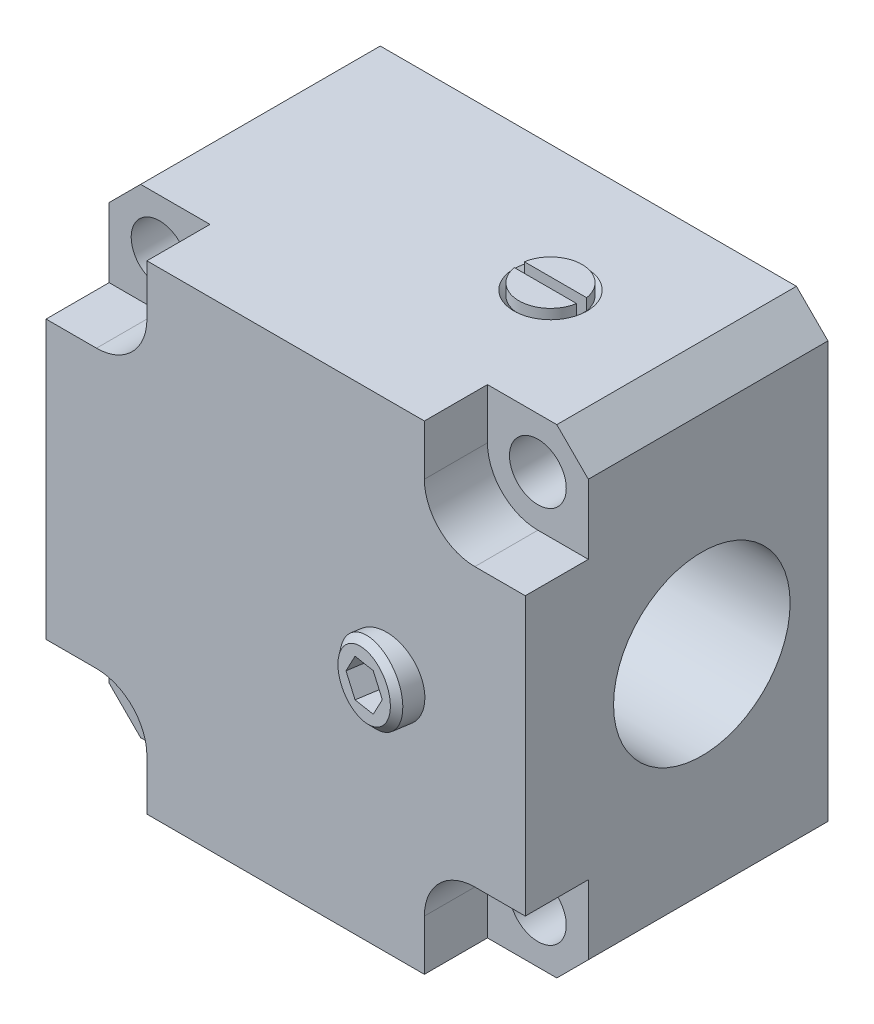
ISO-10303-21;
HEADER;
FILE_DESCRIPTION(('STEP AP214'),'2;1');
FILE_NAME('part.step','',(''),(''),'','','');
FILE_SCHEMA(('AUTOMOTIVE_DESIGN { 1 0 10303 214 1 1 1 1 }'));
ENDSEC;
DATA;
#1=APPLICATION_CONTEXT('core data for automotive mechanical design processes');
#2=APPLICATION_PROTOCOL_DEFINITION('international standard','automotive_design',2000,#1);
#3=PRODUCT_CONTEXT('',#1,'mechanical');
#4=PRODUCT('Part','Part','',(#3));
#5=PRODUCT_RELATED_PRODUCT_CATEGORY('part','',(#4));
#6=PRODUCT_DEFINITION_FORMATION('','',#4);
#7=PRODUCT_DEFINITION_CONTEXT('part definition',#1,'design');
#8=PRODUCT_DEFINITION('design','',#6,#7);
#9=PRODUCT_DEFINITION_SHAPE('','',#8);
#10=(LENGTH_UNIT() NAMED_UNIT(*) SI_UNIT(.MILLI.,.METRE.));
#11=(NAMED_UNIT(*) PLANE_ANGLE_UNIT() SI_UNIT($,.RADIAN.));
#12=(NAMED_UNIT(*) SI_UNIT($,.STERADIAN.) SOLID_ANGLE_UNIT());
#13=UNCERTAINTY_MEASURE_WITH_UNIT(LENGTH_MEASURE(1.E-05),#10,'distance_accuracy_value','');
#14=(GEOMETRIC_REPRESENTATION_CONTEXT(3) GLOBAL_UNCERTAINTY_ASSIGNED_CONTEXT((#13)) GLOBAL_UNIT_ASSIGNED_CONTEXT((#10,
#11,#12)) REPRESENTATION_CONTEXT('',''));
#15=CARTESIAN_POINT('',(0.,0.,0.));
#16=DIRECTION('',(0.,0.,1.));
#17=DIRECTION('',(1.,0.,0.));
#18=AXIS2_PLACEMENT_3D('',#15,#16,#17);
#19=CARTESIAN_POINT('',(38.8239072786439,15.,10.));
#20=DIRECTION('',(1.,0.,0.));
#21=DIRECTION('',(0.,0.,1.));
#22=AXIS2_PLACEMENT_3D('',#19,#20,#21);
#23=CYLINDRICAL_SURFACE('',#22,7.);
#24=CARTESIAN_POINT('',(34.,15.,10.));
#25=DIRECTION('',(1.,0.,0.));
#26=DIRECTION('',(0.,0.,1.));
#27=AXIS2_PLACEMENT_3D('',#24,#25,#26);
#28=CIRCLE('',#27,7.);
#29=CARTESIAN_POINT('',(34.,15.,17.));
#30=VERTEX_POINT('',#29);
#31=EDGE_CURVE('E798',#30,#30,#28,.T.);
#32=ORIENTED_EDGE('',*,*,#31,.T.);
#33=EDGE_LOOP('',(#32));
#34=FACE_BOUND('',#33,.T.);
#35=CARTESIAN_POINT('',(11.,15.,10.));
#36=DIRECTION('',(1.,0.,0.));
#37=DIRECTION('',(0.,0.,1.));
#38=AXIS2_PLACEMENT_3D('',#35,#36,#37);
#39=CIRCLE('',#38,7.);
#40=CARTESIAN_POINT('',(11.,15.,17.));
#41=VERTEX_POINT('',#40);
#42=EDGE_CURVE('E795',#41,#41,#39,.T.);
#43=ORIENTED_EDGE('',*,*,#42,.F.);
#44=EDGE_LOOP('',(#43));
#45=FACE_BOUND('',#44,.T.);
#46=ADVANCED_FACE('F15',(#34,#45),#23,.F.);
#47=CARTESIAN_POINT('',(34.,34.,24.));
#48=DIRECTION('',(-1.,0.,0.));
#49=DIRECTION('',(0.,0.,-1.));
#50=AXIS2_PLACEMENT_3D('',#47,#48,#49);
#51=PLANE('',#50);
#52=DIRECTION('',(0.,1.,0.));
#53=VECTOR('',#52,1.);
#54=CARTESIAN_POINT('',(34.,34.,0.));
#55=LINE('',#54,#53);
#56=CARTESIAN_POINT('',(34.,-1.5,0.));
#57=VERTEX_POINT('',#56);
#58=CARTESIAN_POINT('',(34.,31.5,0.));
#59=VERTEX_POINT('',#58);
#60=EDGE_CURVE('E820',#57,#59,#55,.T.);
#61=ORIENTED_EDGE('',*,*,#60,.T.);
#62=DIRECTION('',(0.,0.,1.));
#63=VECTOR('',#62,1.);
#64=CARTESIAN_POINT('',(34.,31.5,24.));
#65=LINE('',#64,#63);
#66=CARTESIAN_POINT('',(34.,31.5,19.));
#67=VERTEX_POINT('',#66);
#68=EDGE_CURVE('E341',#59,#67,#65,.T.);
#69=ORIENTED_EDGE('',*,*,#68,.T.);
#70=DIRECTION('',(0.,1.,0.));
#71=VECTOR('',#70,1.);
#72=CARTESIAN_POINT('',(34.,34.,19.));
#73=LINE('',#72,#71);
#74=CARTESIAN_POINT('',(34.,26.,19.));
#75=VERTEX_POINT('',#74);
#76=EDGE_CURVE('E698',#75,#67,#73,.T.);
#77=ORIENTED_EDGE('',*,*,#76,.F.);
#78=DIRECTION('',(0.,0.,1.));
#79=VECTOR('',#78,1.);
#80=CARTESIAN_POINT('',(34.,26.,19.));
#81=LINE('',#80,#79);
#82=CARTESIAN_POINT('',(34.,26.,24.));
#83=VERTEX_POINT('',#82);
#84=EDGE_CURVE('E719',#75,#83,#81,.T.);
#85=ORIENTED_EDGE('',*,*,#84,.T.);
#86=DIRECTION('',(0.,1.,0.));
#87=VECTOR('',#86,1.);
#88=CARTESIAN_POINT('',(34.,34.,24.));
#89=LINE('',#88,#87);
#90=CARTESIAN_POINT('',(34.,4.,24.));
#91=VERTEX_POINT('',#90);
#92=EDGE_CURVE('E808',#91,#83,#89,.T.);
#93=ORIENTED_EDGE('',*,*,#92,.F.);
#94=DIRECTION('',(0.,0.,1.));
#95=VECTOR('',#94,1.);
#96=CARTESIAN_POINT('',(34.,4.,19.));
#97=LINE('',#96,#95);
#98=CARTESIAN_POINT('',(34.,4.,19.));
#99=VERTEX_POINT('',#98);
#100=EDGE_CURVE('E337',#99,#91,#97,.T.);
#101=ORIENTED_EDGE('',*,*,#100,.F.);
#102=DIRECTION('',(0.,1.,0.));
#103=VECTOR('',#102,1.);
#104=CARTESIAN_POINT('',(34.,-4.,19.));
#105=LINE('',#104,#103);
#106=CARTESIAN_POINT('',(34.,-1.5,19.));
#107=VERTEX_POINT('',#106);
#108=EDGE_CURVE('E318',#107,#99,#105,.T.);
#109=ORIENTED_EDGE('',*,*,#108,.F.);
#110=DIRECTION('',(0.,0.,-1.));
#111=VECTOR('',#110,1.);
#112=CARTESIAN_POINT('',(34.,-1.5,24.));
#113=LINE('',#112,#111);
#114=EDGE_CURVE('E334',#107,#57,#113,.T.);
#115=ORIENTED_EDGE('',*,*,#114,.T.);
#116=EDGE_LOOP('',(#61,#69,#77,#85,#93,#101,#109,#115));
#117=FACE_BOUND('',#116,.T.);
#118=ORIENTED_EDGE('',*,*,#31,.F.);
#119=EDGE_LOOP('',(#118));
#120=FACE_BOUND('',#119,.T.);
#121=ADVANCED_FACE('F332',(#117,#120),#51,.F.);
#122=CARTESIAN_POINT('',(11.,15.,17.));
#123=DIRECTION('',(-1.,0.,0.));
#124=DIRECTION('',(0.,0.,-1.));
#125=AXIS2_PLACEMENT_3D('',#122,#123,#124);
#126=PLANE('',#125);
#127=CARTESIAN_POINT('',(11.,15.,10.));
#128=DIRECTION('',(1.,0.,0.));
#129=DIRECTION('',(0.,0.,1.));
#130=AXIS2_PLACEMENT_3D('',#127,#128,#129);
#131=CIRCLE('',#130,5.25);
#132=CARTESIAN_POINT('',(11.,15.,15.25));
#133=VERTEX_POINT('',#132);
#134=EDGE_CURVE('E518',#133,#133,#131,.T.);
#135=ORIENTED_EDGE('',*,*,#134,.F.);
#136=EDGE_LOOP('',(#135));
#137=FACE_BOUND('',#136,.T.);
#138=ORIENTED_EDGE('',*,*,#42,.T.);
#139=EDGE_LOOP('',(#138));
#140=FACE_BOUND('',#139,.T.);
#141=ADVANCED_FACE('F984',(#137,#140),#126,.F.);
#142=CARTESIAN_POINT('',(-4.,-4.,0.));
#143=DIRECTION('',(0.,0.,-1.));
#144=DIRECTION('',(1.,0.,0.));
#145=AXIS2_PLACEMENT_3D('',#142,#143,#144);
#146=PLANE('',#145);
#147=DIRECTION('',(-0.707106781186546,0.70710678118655,0.));
#148=VECTOR('',#147,1.);
#149=CARTESIAN_POINT('',(32.75,32.75,0.));
#150=LINE('',#149,#148);
#151=CARTESIAN_POINT('',(31.5,34.,0.));
#152=VERTEX_POINT('',#151);
#153=EDGE_CURVE('E837',#152,#59,#150,.F.);
#154=ORIENTED_EDGE('',*,*,#153,.T.);
#155=ORIENTED_EDGE('',*,*,#60,.F.);
#156=DIRECTION('',(0.70710678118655,0.707106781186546,0.));
#157=VECTOR('',#156,1.);
#158=CARTESIAN_POINT('',(13.75,-21.75,0.));
#159=LINE('',#158,#157);
#160=CARTESIAN_POINT('',(31.5,-4.,0.));
#161=VERTEX_POINT('',#160);
#162=EDGE_CURVE('E340',#57,#161,#159,.F.);
#163=ORIENTED_EDGE('',*,*,#162,.T.);
#164=DIRECTION('',(1.,0.,0.));
#165=VECTOR('',#164,1.);
#166=CARTESIAN_POINT('',(34.,-4.,0.));
#167=LINE('',#166,#165);
#168=CARTESIAN_POINT('',(-1.5,-4.,0.));
#169=VERTEX_POINT('',#168);
#170=EDGE_CURVE('E817',#169,#161,#167,.T.);
#171=ORIENTED_EDGE('',*,*,#170,.F.);
#172=DIRECTION('',(0.707106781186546,-0.70710678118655,0.));
#173=VECTOR('',#172,1.);
#174=CARTESIAN_POINT('',(-2.75,-2.75,0.));
#175=LINE('',#174,#173);
#176=CARTESIAN_POINT('',(-4.,-1.5,0.));
#177=VERTEX_POINT('',#176);
#178=EDGE_CURVE('E840',#169,#177,#175,.F.);
#179=ORIENTED_EDGE('',*,*,#178,.T.);
#180=DIRECTION('',(0.,-1.,0.));
#181=VECTOR('',#180,1.);
#182=CARTESIAN_POINT('',(-4.,34.,0.));
#183=LINE('',#182,#181);
#184=CARTESIAN_POINT('',(-4.,31.5,0.));
#185=VERTEX_POINT('',#184);
#186=EDGE_CURVE('E801',#185,#177,#183,.T.);
#187=ORIENTED_EDGE('',*,*,#186,.F.);
#188=DIRECTION('',(-0.70710678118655,-0.707106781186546,0.));
#189=VECTOR('',#188,1.);
#190=CARTESIAN_POINT('',(-21.75,13.75,0.));
#191=LINE('',#190,#189);
#192=CARTESIAN_POINT('',(-1.5,34.,0.));
#193=VERTEX_POINT('',#192);
#194=EDGE_CURVE('E842',#185,#193,#191,.F.);
#195=ORIENTED_EDGE('',*,*,#194,.T.);
#196=DIRECTION('',(-1.,0.,0.));
#197=VECTOR('',#196,1.);
#198=CARTESIAN_POINT('',(34.,34.,0.));
#199=LINE('',#198,#197);
#200=EDGE_CURVE('E805',#152,#193,#199,.T.);
#201=ORIENTED_EDGE('',*,*,#200,.F.);
#202=EDGE_LOOP('',(#154,#155,#163,#171,#179,#187,#195,#201));
#203=FACE_BOUND('',#202,.T.);
#204=CARTESIAN_POINT('',(30.,0.,0.));
#205=DIRECTION('',(0.,0.,1.));
#206=DIRECTION('',(-1.,0.,0.));
#207=AXIS2_PLACEMENT_3D('',#204,#205,#206);
#208=CIRCLE('',#207,2.25);
#209=CARTESIAN_POINT('',(27.75,0.,0.));
#210=VERTEX_POINT('',#209);
#211=EDGE_CURVE('E783',#210,#210,#208,.T.);
#212=ORIENTED_EDGE('',*,*,#211,.T.);
#213=EDGE_LOOP('',(#212));
#214=FACE_BOUND('',#213,.T.);
#215=CARTESIAN_POINT('',(0.,30.,0.));
#216=DIRECTION('',(0.,0.,1.));
#217=DIRECTION('',(-1.,0.,0.));
#218=AXIS2_PLACEMENT_3D('',#215,#216,#217);
#219=CIRCLE('',#218,2.25);
#220=CARTESIAN_POINT('',(-2.25,30.,0.));
#221=VERTEX_POINT('',#220);
#222=EDGE_CURVE('E789',#221,#221,#219,.T.);
#223=ORIENTED_EDGE('',*,*,#222,.T.);
#224=EDGE_LOOP('',(#223));
#225=FACE_BOUND('',#224,.T.);
#226=CARTESIAN_POINT('',(30.,30.,0.));
#227=DIRECTION('',(0.,0.,1.));
#228=DIRECTION('',(-1.,0.,0.));
#229=AXIS2_PLACEMENT_3D('',#226,#227,#228);
#230=CIRCLE('',#229,2.25);
#231=CARTESIAN_POINT('',(27.75,30.,0.));
#232=VERTEX_POINT('',#231);
#233=EDGE_CURVE('E786',#232,#232,#230,.T.);
#234=ORIENTED_EDGE('',*,*,#233,.T.);
#235=EDGE_LOOP('',(#234));
#236=FACE_BOUND('',#235,.T.);
#237=CARTESIAN_POINT('',(0.,0.,0.));
#238=DIRECTION('',(0.,0.,1.));
#239=DIRECTION('',(-1.,0.,0.));
#240=AXIS2_PLACEMENT_3D('',#237,#238,#239);
#241=CIRCLE('',#240,2.25);
#242=CARTESIAN_POINT('',(-2.25,0.,0.));
#243=VERTEX_POINT('',#242);
#244=EDGE_CURVE('E780',#243,#243,#241,.T.);
#245=ORIENTED_EDGE('',*,*,#244,.T.);
#246=EDGE_LOOP('',(#245));
#247=FACE_BOUND('',#246,.T.);
#248=ADVANCED_FACE('F862',(#203,#214,#225,#236,#247),#146,.T.);
#249=CARTESIAN_POINT('',(31.5,34.,24.));
#250=DIRECTION('',(-0.70710678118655,-0.707106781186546,0.));
#251=DIRECTION('',(0.707106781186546,-0.70710678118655,0.));
#252=AXIS2_PLACEMENT_3D('',#249,#250,#251);
#253=PLANE('',#252);
#254=DIRECTION('',(0.707106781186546,-0.70710678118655,0.));
#255=VECTOR('',#254,1.);
#256=CARTESIAN_POINT('',(31.5,34.,19.));
#257=LINE('',#256,#255);
#258=CARTESIAN_POINT('',(31.5,34.,19.));
#259=VERTEX_POINT('',#258);
#260=EDGE_CURVE('E327',#67,#259,#257,.F.);
#261=ORIENTED_EDGE('',*,*,#260,.F.);
#262=ORIENTED_EDGE('',*,*,#68,.F.);
#263=ORIENTED_EDGE('',*,*,#153,.F.);
#264=DIRECTION('',(0.,0.,-1.));
#265=VECTOR('',#264,1.);
#266=CARTESIAN_POINT('',(31.5,34.,24.));
#267=LINE('',#266,#265);
#268=EDGE_CURVE('E844',#259,#152,#267,.T.);
#269=ORIENTED_EDGE('',*,*,#268,.F.);
#270=EDGE_LOOP('',(#261,#262,#263,#269));
#271=FACE_BOUND('',#270,.T.);
#272=ADVANCED_FACE('F876',(#271),#253,.F.);
#273=CARTESIAN_POINT('',(30.,30.,19.));
#274=DIRECTION('',(0.,0.,-1.));
#275=DIRECTION('',(1.,0.,0.));
#276=AXIS2_PLACEMENT_3D('',#273,#274,#275);
#277=PLANE('',#276);
#278=ORIENTED_EDGE('',*,*,#76,.T.);
#279=ORIENTED_EDGE('',*,*,#260,.T.);
#280=DIRECTION('',(-1.,0.,0.));
#281=VECTOR('',#280,1.);
#282=CARTESIAN_POINT('',(34.,34.,19.));
#283=LINE('',#282,#281);
#284=CARTESIAN_POINT('',(26.,34.,19.));
#285=VERTEX_POINT('',#284);
#286=EDGE_CURVE('E701',#259,#285,#283,.T.);
#287=ORIENTED_EDGE('',*,*,#286,.T.);
#288=DIRECTION('',(0.,-1.,0.));
#289=VECTOR('',#288,1.);
#290=CARTESIAN_POINT('',(26.,34.,19.));
#291=LINE('',#290,#289);
#292=CARTESIAN_POINT('',(26.,30.,19.));
#293=VERTEX_POINT('',#292);
#294=EDGE_CURVE('E703',#285,#293,#291,.T.);
#295=ORIENTED_EDGE('',*,*,#294,.T.);
#296=CARTESIAN_POINT('',(30.,30.,19.));
#297=DIRECTION('',(0.,0.,1.));
#298=DIRECTION('',(1.,0.,0.));
#299=AXIS2_PLACEMENT_3D('',#296,#297,#298);
#300=CIRCLE('',#299,4.);
#301=CARTESIAN_POINT('',(30.,26.,19.));
#302=VERTEX_POINT('',#301);
#303=EDGE_CURVE('E691',#293,#302,#300,.T.);
#304=ORIENTED_EDGE('',*,*,#303,.T.);
#305=DIRECTION('',(1.,0.,0.));
#306=VECTOR('',#305,1.);
#307=CARTESIAN_POINT('',(34.,26.,19.));
#308=LINE('',#307,#306);
#309=EDGE_CURVE('E694',#302,#75,#308,.T.);
#310=ORIENTED_EDGE('',*,*,#309,.T.);
#311=EDGE_LOOP('',(#278,#279,#287,#295,#304,#310));
#312=FACE_BOUND('',#311,.T.);
#313=CARTESIAN_POINT('',(30.,30.,19.));
#314=DIRECTION('',(0.,0.,-1.));
#315=DIRECTION('',(1.,0.,0.));
#316=AXIS2_PLACEMENT_3D('',#313,#314,#315);
#317=CIRCLE('',#316,2.25);
#318=CARTESIAN_POINT('',(32.25,30.,19.));
#319=VERTEX_POINT('',#318);
#320=EDGE_CURVE('E716',#319,#319,#317,.F.);
#321=ORIENTED_EDGE('',*,*,#320,.F.);
#322=EDGE_LOOP('',(#321));
#323=FACE_BOUND('',#322,.T.);
#324=ADVANCED_FACE('F871',(#312,#323),#277,.F.);
#325=CARTESIAN_POINT('',(34.,26.,19.));
#326=DIRECTION('',(0.,-1.,0.));
#327=DIRECTION('',(0.,0.,1.));
#328=AXIS2_PLACEMENT_3D('',#325,#326,#327);
#329=PLANE('',#328);
#330=DIRECTION('',(1.,0.,0.));
#331=VECTOR('',#330,1.);
#332=CARTESIAN_POINT('',(34.,26.,24.));
#333=LINE('',#332,#331);
#334=CARTESIAN_POINT('',(30.,26.,24.));
#335=VERTEX_POINT('',#334);
#336=EDGE_CURVE('E710',#335,#83,#333,.T.);
#337=ORIENTED_EDGE('',*,*,#336,.T.);
#338=ORIENTED_EDGE('',*,*,#84,.F.);
#339=ORIENTED_EDGE('',*,*,#309,.F.);
#340=DIRECTION('',(0.,0.,1.));
#341=VECTOR('',#340,1.);
#342=CARTESIAN_POINT('',(30.,26.,19.));
#343=LINE('',#342,#341);
#344=EDGE_CURVE('E706',#302,#335,#343,.T.);
#345=ORIENTED_EDGE('',*,*,#344,.T.);
#346=EDGE_LOOP('',(#337,#338,#339,#345));
#347=FACE_BOUND('',#346,.T.);
#348=ADVANCED_FACE('F923',(#347),#329,.F.);
#349=CARTESIAN_POINT('',(-4.,-4.,24.));
#350=DIRECTION('',(0.,0.,-1.));
#351=DIRECTION('',(1.,0.,0.));
#352=AXIS2_PLACEMENT_3D('',#349,#350,#351);
#353=PLANE('',#352);
#354=CARTESIAN_POINT('',(0.,30.,24.));
#355=DIRECTION('',(0.,0.,1.));
#356=DIRECTION('',(-1.,0.,0.));
#357=AXIS2_PLACEMENT_3D('',#354,#355,#356);
#358=CIRCLE('',#357,4.);
#359=CARTESIAN_POINT('',(0.,26.,24.));
#360=VERTEX_POINT('',#359);
#361=CARTESIAN_POINT('',(4.,30.,24.));
#362=VERTEX_POINT('',#361);
#363=EDGE_CURVE('E660',#360,#362,#358,.T.);
#364=ORIENTED_EDGE('',*,*,#363,.F.);
#365=DIRECTION('',(1.,0.,0.));
#366=VECTOR('',#365,1.);
#367=CARTESIAN_POINT('',(-4.,26.,24.));
#368=LINE('',#367,#366);
#369=CARTESIAN_POINT('',(-4.,26.,24.));
#370=VERTEX_POINT('',#369);
#371=EDGE_CURVE('E665',#370,#360,#368,.T.);
#372=ORIENTED_EDGE('',*,*,#371,.F.);
#373=DIRECTION('',(0.,-1.,0.));
#374=VECTOR('',#373,1.);
#375=CARTESIAN_POINT('',(-4.,34.,24.));
#376=LINE('',#375,#374);
#377=CARTESIAN_POINT('',(-4.,4.,24.));
#378=VERTEX_POINT('',#377);
#379=EDGE_CURVE('E802',#370,#378,#376,.T.);
#380=ORIENTED_EDGE('',*,*,#379,.T.);
#381=DIRECTION('',(-1.,0.,0.));
#382=VECTOR('',#381,1.);
#383=CARTESIAN_POINT('',(-4.,4.,24.));
#384=LINE('',#383,#382);
#385=CARTESIAN_POINT('',(0.,4.,24.));
#386=VERTEX_POINT('',#385);
#387=EDGE_CURVE('E751',#386,#378,#384,.T.);
#388=ORIENTED_EDGE('',*,*,#387,.F.);
#389=CARTESIAN_POINT('',(0.,0.,24.));
#390=DIRECTION('',(0.,0.,1.));
#391=DIRECTION('',(1.,0.,0.));
#392=AXIS2_PLACEMENT_3D('',#389,#390,#391);
#393=CIRCLE('',#392,4.);
#394=CARTESIAN_POINT('',(4.,0.,24.));
#395=VERTEX_POINT('',#394);
#396=EDGE_CURVE('E766',#395,#386,#393,.T.);
#397=ORIENTED_EDGE('',*,*,#396,.F.);
#398=DIRECTION('',(0.,1.,0.));
#399=VECTOR('',#398,1.);
#400=CARTESIAN_POINT('',(4.,-4.,24.));
#401=LINE('',#400,#399);
#402=CARTESIAN_POINT('',(4.,-4.,24.));
#403=VERTEX_POINT('',#402);
#404=EDGE_CURVE('E763',#403,#395,#401,.T.);
#405=ORIENTED_EDGE('',*,*,#404,.F.);
#406=DIRECTION('',(1.,0.,0.));
#407=VECTOR('',#406,1.);
#408=CARTESIAN_POINT('',(34.,-4.,24.));
#409=LINE('',#408,#407);
#410=CARTESIAN_POINT('',(26.,-4.,24.));
#411=VERTEX_POINT('',#410);
#412=EDGE_CURVE('E804',#403,#411,#409,.T.);
#413=ORIENTED_EDGE('',*,*,#412,.T.);
#414=DIRECTION('',(0.,-1.,0.));
#415=VECTOR('',#414,1.);
#416=CARTESIAN_POINT('',(26.,-4.,24.));
#417=LINE('',#416,#415);
#418=CARTESIAN_POINT('',(26.,0.,24.));
#419=VERTEX_POINT('',#418);
#420=EDGE_CURVE('E735',#419,#411,#417,.T.);
#421=ORIENTED_EDGE('',*,*,#420,.F.);
#422=CARTESIAN_POINT('',(30.,0.,24.));
#423=DIRECTION('',(0.,0.,1.));
#424=DIRECTION('',(-1.,0.,0.));
#425=AXIS2_PLACEMENT_3D('',#422,#423,#424);
#426=CIRCLE('',#425,4.);
#427=CARTESIAN_POINT('',(30.,4.,24.));
#428=VERTEX_POINT('',#427);
#429=EDGE_CURVE('E732',#428,#419,#426,.T.);
#430=ORIENTED_EDGE('',*,*,#429,.F.);
#431=DIRECTION('',(-1.,0.,0.));
#432=VECTOR('',#431,1.);
#433=CARTESIAN_POINT('',(34.,4.,24.));
#434=LINE('',#433,#432);
#435=EDGE_CURVE('E727',#91,#428,#434,.T.);
#436=ORIENTED_EDGE('',*,*,#435,.F.);
#437=ORIENTED_EDGE('',*,*,#92,.T.);
#438=ORIENTED_EDGE('',*,*,#336,.F.);
#439=CARTESIAN_POINT('',(30.,30.,24.));
#440=DIRECTION('',(0.,0.,1.));
#441=DIRECTION('',(1.,0.,0.));
#442=AXIS2_PLACEMENT_3D('',#439,#440,#441);
#443=CIRCLE('',#442,4.);
#444=CARTESIAN_POINT('',(26.,30.,24.));
#445=VERTEX_POINT('',#444);
#446=EDGE_CURVE('E707',#445,#335,#443,.T.);
#447=ORIENTED_EDGE('',*,*,#446,.F.);
#448=DIRECTION('',(0.,-1.,0.));
#449=VECTOR('',#448,1.);
#450=CARTESIAN_POINT('',(26.,34.,24.));
#451=LINE('',#450,#449);
#452=CARTESIAN_POINT('',(26.,34.,24.));
#453=VERTEX_POINT('',#452);
#454=EDGE_CURVE('E695',#453,#445,#451,.T.);
#455=ORIENTED_EDGE('',*,*,#454,.F.);
#456=DIRECTION('',(-1.,0.,0.));
#457=VECTOR('',#456,1.);
#458=CARTESIAN_POINT('',(34.,34.,24.));
#459=LINE('',#458,#457);
#460=CARTESIAN_POINT('',(4.,34.,24.));
#461=VERTEX_POINT('',#460);
#462=EDGE_CURVE('E811',#453,#461,#459,.T.);
#463=ORIENTED_EDGE('',*,*,#462,.T.);
#464=DIRECTION('',(0.,1.,0.));
#465=VECTOR('',#464,1.);
#466=CARTESIAN_POINT('',(4.,34.,24.));
#467=LINE('',#466,#465);
#468=EDGE_CURVE('E678',#362,#461,#467,.T.);
#469=ORIENTED_EDGE('',*,*,#468,.F.);
#470=EDGE_LOOP('',(#364,#372,#380,#388,#397,#405,#413,#421,#430,#436,#437,#438,#447,#455,#463,#469));
#471=FACE_BOUND('',#470,.T.);
#472=CARTESIAN_POINT('',(23.,15.,24.));
#473=DIRECTION('',(0.,0.,-1.));
#474=DIRECTION('',(1.,0.,0.));
#475=AXIS2_PLACEMENT_3D('',#472,#473,#474);
#476=ELLIPSE('',#475,3.03739537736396,3.);
#477=CARTESIAN_POINT('',(26.037395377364,15.,24.));
#478=VERTEX_POINT('',#477);
#479=EDGE_CURVE('E601',#478,#478,#476,.T.);
#480=ORIENTED_EDGE('',*,*,#479,.T.);
#481=EDGE_LOOP('',(#480));
#482=FACE_BOUND('',#481,.T.);
#483=ADVANCED_FACE('F912',(#471,#482),#353,.F.);
#484=CARTESIAN_POINT('',(34.,4.,19.));
#485=DIRECTION('',(0.,1.,0.));
#486=DIRECTION('',(0.,0.,-1.));
#487=AXIS2_PLACEMENT_3D('',#484,#485,#486);
#488=PLANE('',#487);
#489=ORIENTED_EDGE('',*,*,#435,.T.);
#490=DIRECTION('',(0.,0.,1.));
#491=VECTOR('',#490,1.);
#492=CARTESIAN_POINT('',(30.,4.,19.));
#493=LINE('',#492,#491);
#494=CARTESIAN_POINT('',(30.,4.,19.));
#495=VERTEX_POINT('',#494);
#496=EDGE_CURVE('E739',#495,#428,#493,.T.);
#497=ORIENTED_EDGE('',*,*,#496,.F.);
#498=DIRECTION('',(-1.,0.,0.));
#499=VECTOR('',#498,1.);
#500=CARTESIAN_POINT('',(34.,4.,19.));
#501=LINE('',#500,#499);
#502=EDGE_CURVE('E338',#99,#495,#501,.T.);
#503=ORIENTED_EDGE('',*,*,#502,.F.);
#504=ORIENTED_EDGE('',*,*,#100,.T.);
#505=EDGE_LOOP('',(#489,#497,#503,#504));
#506=FACE_BOUND('',#505,.T.);
#507=ADVANCED_FACE('F928',(#506),#488,.F.);
#508=CARTESIAN_POINT('',(30.,0.,19.));
#509=DIRECTION('',(0.,0.,1.));
#510=DIRECTION('',(-1.,0.,0.));
#511=AXIS2_PLACEMENT_3D('',#508,#509,#510);
#512=PLANE('',#511);
#513=DIRECTION('',(1.,0.,0.));
#514=VECTOR('',#513,1.);
#515=CARTESIAN_POINT('',(34.,-4.,19.));
#516=LINE('',#515,#514);
#517=CARTESIAN_POINT('',(26.,-4.,19.));
#518=VERTEX_POINT('',#517);
#519=CARTESIAN_POINT('',(31.5,-4.,19.));
#520=VERTEX_POINT('',#519);
#521=EDGE_CURVE('E322',#518,#520,#516,.T.);
#522=ORIENTED_EDGE('',*,*,#521,.T.);
#523=DIRECTION('',(-0.70710678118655,-0.707106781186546,0.));
#524=VECTOR('',#523,1.);
#525=CARTESIAN_POINT('',(32.75,-2.75,19.));
#526=LINE('',#525,#524);
#527=EDGE_CURVE('E313',#520,#107,#526,.F.);
#528=ORIENTED_EDGE('',*,*,#527,.T.);
#529=ORIENTED_EDGE('',*,*,#108,.T.);
#530=ORIENTED_EDGE('',*,*,#502,.T.);
#531=CARTESIAN_POINT('',(30.,0.,19.));
#532=DIRECTION('',(0.,0.,1.));
#533=DIRECTION('',(-1.,0.,0.));
#534=AXIS2_PLACEMENT_3D('',#531,#532,#533);
#535=CIRCLE('',#534,4.);
#536=CARTESIAN_POINT('',(26.,0.,19.));
#537=VERTEX_POINT('',#536);
#538=EDGE_CURVE('E723',#495,#537,#535,.T.);
#539=ORIENTED_EDGE('',*,*,#538,.T.);
#540=DIRECTION('',(0.,-1.,0.));
#541=VECTOR('',#540,1.);
#542=CARTESIAN_POINT('',(26.,-4.,19.));
#543=LINE('',#542,#541);
#544=EDGE_CURVE('E726',#537,#518,#543,.T.);
#545=ORIENTED_EDGE('',*,*,#544,.T.);
#546=EDGE_LOOP('',(#522,#528,#529,#530,#539,#545));
#547=FACE_BOUND('',#546,.T.);
#548=CARTESIAN_POINT('',(30.,0.,19.));
#549=DIRECTION('',(0.,0.,1.));
#550=DIRECTION('',(-1.,0.,0.));
#551=AXIS2_PLACEMENT_3D('',#548,#549,#550);
#552=CIRCLE('',#551,2.25);
#553=CARTESIAN_POINT('',(27.75,0.,19.));
#554=VERTEX_POINT('',#553);
#555=EDGE_CURVE('E741',#554,#554,#552,.F.);
#556=ORIENTED_EDGE('',*,*,#555,.T.);
#557=EDGE_LOOP('',(#556));
#558=FACE_BOUND('',#557,.T.);
#559=ADVANCED_FACE('F315',(#547,#558),#512,.T.);
#560=CARTESIAN_POINT('',(34.,-1.5,24.));
#561=DIRECTION('',(-0.707106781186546,0.70710678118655,0.));
#562=DIRECTION('',(-0.70710678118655,-0.707106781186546,0.));
#563=AXIS2_PLACEMENT_3D('',#560,#561,#562);
#564=PLANE('',#563);
#565=ORIENTED_EDGE('',*,*,#527,.F.);
#566=DIRECTION('',(0.,0.,1.));
#567=VECTOR('',#566,1.);
#568=CARTESIAN_POINT('',(31.5,-4.,24.));
#569=LINE('',#568,#567);
#570=EDGE_CURVE('E851',#161,#520,#569,.T.);
#571=ORIENTED_EDGE('',*,*,#570,.F.);
#572=ORIENTED_EDGE('',*,*,#162,.F.);
#573=ORIENTED_EDGE('',*,*,#114,.F.);
#574=EDGE_LOOP('',(#565,#571,#572,#573));
#575=FACE_BOUND('',#574,.T.);
#576=ADVANCED_FACE('F17',(#575),#564,.F.);
#577=CARTESIAN_POINT('',(2.,15.,10.));
#578=DIRECTION('',(1.,0.,0.));
#579=DIRECTION('',(0.,0.,1.));
#580=AXIS2_PLACEMENT_3D('',#577,#578,#579);
#581=CYLINDRICAL_SURFACE('',#580,5.25);
#582=CARTESIAN_POINT('',(2.,15.,10.));
#583=DIRECTION('',(1.,0.,0.));
#584=DIRECTION('',(0.,0.,1.));
#585=AXIS2_PLACEMENT_3D('',#582,#583,#584);
#586=CIRCLE('',#585,5.25);
#587=CARTESIAN_POINT('',(2.,15.,15.25));
#588=VERTEX_POINT('',#587);
#589=EDGE_CURVE('E354',#588,#588,#586,.T.);
#590=ORIENTED_EDGE('',*,*,#589,.F.);
#591=EDGE_LOOP('',(#590));
#592=FACE_BOUND('',#591,.T.);
#593=ORIENTED_EDGE('',*,*,#134,.T.);
#594=EDGE_LOOP('',(#593));
#595=FACE_BOUND('',#594,.T.);
#596=ADVANCED_FACE('F392',(#592,#595),#581,.F.);
#597=CARTESIAN_POINT('',(30.,0.,24.));
#598=DIRECTION('',(0.,0.,1.));
#599=DIRECTION('',(-1.,0.,0.));
#600=AXIS2_PLACEMENT_3D('',#597,#598,#599);
#601=CYLINDRICAL_SURFACE('',#600,2.25);
#602=ORIENTED_EDGE('',*,*,#211,.F.);
#603=EDGE_LOOP('',(#602));
#604=FACE_BOUND('',#603,.T.);
#605=ORIENTED_EDGE('',*,*,#555,.F.);
#606=EDGE_LOOP('',(#605));
#607=FACE_BOUND('',#606,.T.);
#608=ADVANCED_FACE('F968',(#604,#607),#601,.F.);
#609=CARTESIAN_POINT('',(-4.,34.,24.));
#610=DIRECTION('',(1.,0.,0.));
#611=DIRECTION('',(0.,0.,1.));
#612=AXIS2_PLACEMENT_3D('',#609,#610,#611);
#613=PLANE('',#612);
#614=CARTESIAN_POINT('',(-4.,15.,10.));
#615=DIRECTION('',(1.,0.,0.));
#616=DIRECTION('',(0.,0.,1.));
#617=AXIS2_PLACEMENT_3D('',#614,#615,#616);
#618=CIRCLE('',#617,4.);
#619=CARTESIAN_POINT('',(-4.,15.,14.));
#620=VERTEX_POINT('',#619);
#621=EDGE_CURVE('E792',#620,#620,#618,.T.);
#622=ORIENTED_EDGE('',*,*,#621,.T.);
#623=EDGE_LOOP('',(#622));
#624=FACE_BOUND('',#623,.T.);
#625=DIRECTION('',(0.,-1.,0.));
#626=VECTOR('',#625,1.);
#627=CARTESIAN_POINT('',(-4.,34.,19.));
#628=LINE('',#627,#626);
#629=CARTESIAN_POINT('',(-4.,31.5,19.));
#630=VERTEX_POINT('',#629);
#631=CARTESIAN_POINT('',(-4.,26.,19.));
#632=VERTEX_POINT('',#631);
#633=EDGE_CURVE('E670',#630,#632,#628,.T.);
#634=ORIENTED_EDGE('',*,*,#633,.F.);
#635=DIRECTION('',(0.,0.,-1.));
#636=VECTOR('',#635,1.);
#637=CARTESIAN_POINT('',(-4.,31.5,24.));
#638=LINE('',#637,#636);
#639=EDGE_CURVE('E833',#630,#185,#638,.T.);
#640=ORIENTED_EDGE('',*,*,#639,.T.);
#641=ORIENTED_EDGE('',*,*,#186,.T.);
#642=DIRECTION('',(0.,0.,1.));
#643=VECTOR('',#642,1.);
#644=CARTESIAN_POINT('',(-4.,-1.5,24.));
#645=LINE('',#644,#643);
#646=CARTESIAN_POINT('',(-4.,-1.5,19.));
#647=VERTEX_POINT('',#646);
#648=EDGE_CURVE('E814',#177,#647,#645,.T.);
#649=ORIENTED_EDGE('',*,*,#648,.T.);
#650=DIRECTION('',(0.,-1.,0.));
#651=VECTOR('',#650,1.);
#652=CARTESIAN_POINT('',(-4.,-4.,19.));
#653=LINE('',#652,#651);
#654=CARTESIAN_POINT('',(-4.,4.,19.));
#655=VERTEX_POINT('',#654);
#656=EDGE_CURVE('E747',#655,#647,#653,.T.);
#657=ORIENTED_EDGE('',*,*,#656,.F.);
#658=DIRECTION('',(0.,0.,1.));
#659=VECTOR('',#658,1.);
#660=CARTESIAN_POINT('',(-4.,4.,19.));
#661=LINE('',#660,#659);
#662=EDGE_CURVE('E771',#655,#378,#661,.T.);
#663=ORIENTED_EDGE('',*,*,#662,.T.);
#664=ORIENTED_EDGE('',*,*,#379,.F.);
#665=DIRECTION('',(0.,0.,1.));
#666=VECTOR('',#665,1.);
#667=CARTESIAN_POINT('',(-4.,26.,19.));
#668=LINE('',#667,#666);
#669=EDGE_CURVE('E685',#632,#370,#668,.T.);
#670=ORIENTED_EDGE('',*,*,#669,.F.);
#671=EDGE_LOOP('',(#634,#640,#641,#649,#657,#663,#664,#670));
#672=FACE_BOUND('',#671,.T.);
#673=ADVANCED_FACE('F888',(#624,#672),#613,.F.);
#674=CARTESIAN_POINT('',(-4.,31.5,24.));
#675=DIRECTION('',(0.707106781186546,-0.70710678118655,0.));
#676=DIRECTION('',(0.70710678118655,0.707106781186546,0.));
#677=AXIS2_PLACEMENT_3D('',#674,#675,#676);
#678=PLANE('',#677);
#679=DIRECTION('',(0.70710678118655,0.707106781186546,0.));
#680=VECTOR('',#679,1.);
#681=CARTESIAN_POINT('',(-2.75,32.75,19.));
#682=LINE('',#681,#680);
#683=CARTESIAN_POINT('',(-1.5,34.,19.));
#684=VERTEX_POINT('',#683);
#685=EDGE_CURVE('E849',#684,#630,#682,.F.);
#686=ORIENTED_EDGE('',*,*,#685,.F.);
#687=DIRECTION('',(0.,0.,1.));
#688=VECTOR('',#687,1.);
#689=CARTESIAN_POINT('',(-1.5,34.,24.));
#690=LINE('',#689,#688);
#691=EDGE_CURVE('E847',#193,#684,#690,.T.);
#692=ORIENTED_EDGE('',*,*,#691,.F.);
#693=ORIENTED_EDGE('',*,*,#194,.F.);
#694=ORIENTED_EDGE('',*,*,#639,.F.);
#695=EDGE_LOOP('',(#686,#692,#693,#694));
#696=FACE_BOUND('',#695,.T.);
#697=ADVANCED_FACE('F885',(#696),#678,.F.);
#698=CARTESIAN_POINT('',(34.,34.,24.));
#699=DIRECTION('',(0.,-1.,0.));
#700=DIRECTION('',(0.,0.,1.));
#701=AXIS2_PLACEMENT_3D('',#698,#699,#700);
#702=PLANE('',#701);
#703=ORIENTED_EDGE('',*,*,#200,.T.);
#704=ORIENTED_EDGE('',*,*,#691,.T.);
#705=DIRECTION('',(-1.,0.,0.));
#706=VECTOR('',#705,1.);
#707=CARTESIAN_POINT('',(-4.,34.,19.));
#708=LINE('',#707,#706);
#709=CARTESIAN_POINT('',(4.,34.,19.));
#710=VERTEX_POINT('',#709);
#711=EDGE_CURVE('E667',#710,#684,#708,.T.);
#712=ORIENTED_EDGE('',*,*,#711,.F.);
#713=DIRECTION('',(0.,0.,1.));
#714=VECTOR('',#713,1.);
#715=CARTESIAN_POINT('',(4.,34.,19.));
#716=LINE('',#715,#714);
#717=EDGE_CURVE('E687',#710,#461,#716,.T.);
#718=ORIENTED_EDGE('',*,*,#717,.T.);
#719=ORIENTED_EDGE('',*,*,#462,.F.);
#720=DIRECTION('',(0.,0.,1.));
#721=VECTOR('',#720,1.);
#722=CARTESIAN_POINT('',(26.,34.,19.));
#723=LINE('',#722,#721);
#724=EDGE_CURVE('E717',#285,#453,#723,.T.);
#725=ORIENTED_EDGE('',*,*,#724,.F.);
#726=ORIENTED_EDGE('',*,*,#286,.F.);
#727=ORIENTED_EDGE('',*,*,#268,.T.);
#728=EDGE_LOOP('',(#703,#704,#712,#718,#719,#725,#726,#727));
#729=FACE_BOUND('',#728,.T.);
#730=CARTESIAN_POINT('',(22.,34.,10.));
#731=DIRECTION('',(0.,1.,0.));
#732=DIRECTION('',(0.,0.,-1.));
#733=AXIS2_PLACEMENT_3D('',#730,#731,#732);
#734=CIRCLE('',#733,2.9);
#735=CARTESIAN_POINT('',(22.,34.,7.1));
#736=VERTEX_POINT('',#735);
#737=EDGE_CURVE('E353',#736,#736,#734,.T.);
#738=ORIENTED_EDGE('',*,*,#737,.F.);
#739=EDGE_LOOP('',(#738));
#740=FACE_BOUND('',#739,.T.);
#741=ADVANCED_FACE('F878',(#729,#740),#702,.F.);
#742=CARTESIAN_POINT('',(34.,-4.,24.));
#743=DIRECTION('',(0.,1.,0.));
#744=DIRECTION('',(0.,0.,-1.));
#745=AXIS2_PLACEMENT_3D('',#742,#743,#744);
#746=PLANE('',#745);
#747=CARTESIAN_POINT('',(22.,-4.,10.));
#748=DIRECTION('',(0.,-1.,0.));
#749=DIRECTION('',(0.,0.,1.));
#750=AXIS2_PLACEMENT_3D('',#747,#748,#749);
#751=CIRCLE('',#750,3.);
#752=CARTESIAN_POINT('',(22.,-4.,13.));
#753=VERTEX_POINT('',#752);
#754=EDGE_CURVE('E643',#753,#753,#751,.T.);
#755=ORIENTED_EDGE('',*,*,#754,.F.);
#756=EDGE_LOOP('',(#755));
#757=FACE_BOUND('',#756,.T.);
#758=DIRECTION('',(1.,0.,0.));
#759=VECTOR('',#758,1.);
#760=CARTESIAN_POINT('',(-4.,-4.,19.));
#761=LINE('',#760,#759);
#762=CARTESIAN_POINT('',(-1.5,-4.,19.));
#763=VERTEX_POINT('',#762);
#764=CARTESIAN_POINT('',(4.,-4.,19.));
#765=VERTEX_POINT('',#764);
#766=EDGE_CURVE('E750',#763,#765,#761,.T.);
#767=ORIENTED_EDGE('',*,*,#766,.F.);
#768=DIRECTION('',(0.,0.,-1.));
#769=VECTOR('',#768,1.);
#770=CARTESIAN_POINT('',(-1.5,-4.,24.));
#771=LINE('',#770,#769);
#772=EDGE_CURVE('E345',#763,#169,#771,.T.);
#773=ORIENTED_EDGE('',*,*,#772,.T.);
#774=ORIENTED_EDGE('',*,*,#170,.T.);
#775=ORIENTED_EDGE('',*,*,#570,.T.);
#776=ORIENTED_EDGE('',*,*,#521,.F.);
#777=DIRECTION('',(0.,0.,1.));
#778=VECTOR('',#777,1.);
#779=CARTESIAN_POINT('',(26.,-4.,19.));
#780=LINE('',#779,#778);
#781=EDGE_CURVE('E743',#518,#411,#780,.T.);
#782=ORIENTED_EDGE('',*,*,#781,.T.);
#783=ORIENTED_EDGE('',*,*,#412,.F.);
#784=DIRECTION('',(0.,0.,1.));
#785=VECTOR('',#784,1.);
#786=CARTESIAN_POINT('',(4.,-4.,19.));
#787=LINE('',#786,#785);
#788=EDGE_CURVE('E762',#765,#403,#787,.T.);
#789=ORIENTED_EDGE('',*,*,#788,.F.);
#790=EDGE_LOOP('',(#767,#773,#774,#775,#776,#782,#783,#789));
#791=FACE_BOUND('',#790,.T.);
#792=ADVANCED_FACE('F857',(#757,#791),#746,.F.);
#793=CARTESIAN_POINT('',(-1.5,-4.,24.));
#794=DIRECTION('',(0.70710678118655,0.707106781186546,0.));
#795=DIRECTION('',(-0.707106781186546,0.70710678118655,0.));
#796=AXIS2_PLACEMENT_3D('',#793,#794,#795);
#797=PLANE('',#796);
#798=DIRECTION('',(-0.707106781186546,0.70710678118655,0.));
#799=VECTOR('',#798,1.);
#800=CARTESIAN_POINT('',(-1.5,-4.,19.));
#801=LINE('',#800,#799);
#802=EDGE_CURVE('E342',#647,#763,#801,.F.);
#803=ORIENTED_EDGE('',*,*,#802,.F.);
#804=ORIENTED_EDGE('',*,*,#648,.F.);
#805=ORIENTED_EDGE('',*,*,#178,.F.);
#806=ORIENTED_EDGE('',*,*,#772,.F.);
#807=EDGE_LOOP('',(#803,#804,#805,#806));
#808=FACE_BOUND('',#807,.T.);
#809=ADVANCED_FACE('F947',(#808),#797,.F.);
#810=CARTESIAN_POINT('',(0.,30.,24.));
#811=DIRECTION('',(0.,0.,1.));
#812=DIRECTION('',(-1.,0.,0.));
#813=AXIS2_PLACEMENT_3D('',#810,#811,#812);
#814=CYLINDRICAL_SURFACE('',#813,2.25);
#815=ORIENTED_EDGE('',*,*,#222,.F.);
#816=EDGE_LOOP('',(#815));
#817=FACE_BOUND('',#816,.T.);
#818=CARTESIAN_POINT('',(0.,30.,19.));
#819=DIRECTION('',(0.,0.,1.));
#820=DIRECTION('',(-1.,0.,0.));
#821=AXIS2_PLACEMENT_3D('',#818,#819,#820);
#822=CIRCLE('',#821,2.25);
#823=CARTESIAN_POINT('',(-2.25,30.,19.));
#824=VERTEX_POINT('',#823);
#825=EDGE_CURVE('E684',#824,#824,#822,.F.);
#826=ORIENTED_EDGE('',*,*,#825,.F.);
#827=EDGE_LOOP('',(#826));
#828=FACE_BOUND('',#827,.T.);
#829=ADVANCED_FACE('F974',(#817,#828),#814,.F.);
#830=CARTESIAN_POINT('',(30.,30.,24.));
#831=DIRECTION('',(0.,0.,1.));
#832=DIRECTION('',(-1.,0.,0.));
#833=AXIS2_PLACEMENT_3D('',#830,#831,#832);
#834=CYLINDRICAL_SURFACE('',#833,2.25);
#835=ORIENTED_EDGE('',*,*,#320,.T.);
#836=EDGE_LOOP('',(#835));
#837=FACE_BOUND('',#836,.T.);
#838=ORIENTED_EDGE('',*,*,#233,.F.);
#839=EDGE_LOOP('',(#838));
#840=FACE_BOUND('',#839,.T.);
#841=ADVANCED_FACE('F966',(#837,#840),#834,.F.);
#842=CARTESIAN_POINT('',(0.,0.,24.));
#843=DIRECTION('',(0.,0.,1.));
#844=DIRECTION('',(-1.,0.,0.));
#845=AXIS2_PLACEMENT_3D('',#842,#843,#844);
#846=CYLINDRICAL_SURFACE('',#845,2.25);
#847=CARTESIAN_POINT('',(0.,0.,19.));
#848=DIRECTION('',(0.,0.,-1.));
#849=DIRECTION('',(1.,0.,0.));
#850=AXIS2_PLACEMENT_3D('',#847,#848,#849);
#851=CIRCLE('',#850,2.25);
#852=CARTESIAN_POINT('',(2.25,0.,19.));
#853=VERTEX_POINT('',#852);
#854=EDGE_CURVE('E774',#853,#853,#851,.F.);
#855=ORIENTED_EDGE('',*,*,#854,.T.);
#856=EDGE_LOOP('',(#855));
#857=FACE_BOUND('',#856,.T.);
#858=ORIENTED_EDGE('',*,*,#244,.F.);
#859=EDGE_LOOP('',(#858));
#860=FACE_BOUND('',#859,.T.);
#861=ADVANCED_FACE('F963',(#857,#860),#846,.F.);
#862=CARTESIAN_POINT('',(26.,34.,19.));
#863=DIRECTION('',(-1.,0.,0.));
#864=DIRECTION('',(0.,-1.,0.));
#865=AXIS2_PLACEMENT_3D('',#862,#863,#864);
#866=PLANE('',#865);
#867=ORIENTED_EDGE('',*,*,#454,.T.);
#868=DIRECTION('',(0.,0.,1.));
#869=VECTOR('',#868,1.);
#870=CARTESIAN_POINT('',(26.,30.,19.));
#871=LINE('',#870,#869);
#872=EDGE_CURVE('E714',#293,#445,#871,.T.);
#873=ORIENTED_EDGE('',*,*,#872,.F.);
#874=ORIENTED_EDGE('',*,*,#294,.F.);
#875=ORIENTED_EDGE('',*,*,#724,.T.);
#876=EDGE_LOOP('',(#867,#873,#874,#875));
#877=FACE_BOUND('',#876,.T.);
#878=ADVANCED_FACE('F917',(#877),#866,.F.);
#879=CARTESIAN_POINT('',(30.,30.,19.));
#880=DIRECTION('',(0.,0.,1.));
#881=DIRECTION('',(-1.,0.,0.));
#882=AXIS2_PLACEMENT_3D('',#879,#880,#881);
#883=CYLINDRICAL_SURFACE('',#882,4.);
#884=ORIENTED_EDGE('',*,*,#446,.T.);
#885=ORIENTED_EDGE('',*,*,#344,.F.);
#886=ORIENTED_EDGE('',*,*,#303,.F.);
#887=ORIENTED_EDGE('',*,*,#872,.T.);
#888=EDGE_LOOP('',(#884,#885,#886,#887));
#889=FACE_BOUND('',#888,.T.);
#890=ADVANCED_FACE('F921',(#889),#883,.F.);
#891=CARTESIAN_POINT('',(0.,30.,19.));
#892=DIRECTION('',(0.,0.,1.));
#893=DIRECTION('',(-1.,0.,0.));
#894=AXIS2_PLACEMENT_3D('',#891,#892,#893);
#895=CYLINDRICAL_SURFACE('',#894,4.);
#896=ORIENTED_EDGE('',*,*,#363,.T.);
#897=DIRECTION('',(0.,0.,1.));
#898=VECTOR('',#897,1.);
#899=CARTESIAN_POINT('',(4.,30.,19.));
#900=LINE('',#899,#898);
#901=CARTESIAN_POINT('',(4.,30.,19.));
#902=VERTEX_POINT('',#901);
#903=EDGE_CURVE('E675',#902,#362,#900,.T.);
#904=ORIENTED_EDGE('',*,*,#903,.F.);
#905=CARTESIAN_POINT('',(0.,30.,19.));
#906=DIRECTION('',(0.,0.,1.));
#907=DIRECTION('',(-1.,0.,0.));
#908=AXIS2_PLACEMENT_3D('',#905,#906,#907);
#909=CIRCLE('',#908,4.);
#910=CARTESIAN_POINT('',(0.,26.,19.));
#911=VERTEX_POINT('',#910);
#912=EDGE_CURVE('E661',#911,#902,#909,.T.);
#913=ORIENTED_EDGE('',*,*,#912,.F.);
#914=DIRECTION('',(0.,0.,1.));
#915=VECTOR('',#914,1.);
#916=CARTESIAN_POINT('',(0.,26.,19.));
#917=LINE('',#916,#915);
#918=EDGE_CURVE('E682',#911,#360,#917,.T.);
#919=ORIENTED_EDGE('',*,*,#918,.T.);
#920=EDGE_LOOP('',(#896,#904,#913,#919));
#921=FACE_BOUND('',#920,.T.);
#922=ADVANCED_FACE('F902',(#921),#895,.F.);
#923=CARTESIAN_POINT('',(-4.,26.,19.));
#924=DIRECTION('',(0.,-1.,0.));
#925=DIRECTION('',(0.,0.,1.));
#926=AXIS2_PLACEMENT_3D('',#923,#924,#925);
#927=PLANE('',#926);
#928=ORIENTED_EDGE('',*,*,#371,.T.);
#929=ORIENTED_EDGE('',*,*,#918,.F.);
#930=DIRECTION('',(1.,0.,0.));
#931=VECTOR('',#930,1.);
#932=CARTESIAN_POINT('',(-4.,26.,19.));
#933=LINE('',#932,#931);
#934=EDGE_CURVE('E672',#632,#911,#933,.T.);
#935=ORIENTED_EDGE('',*,*,#934,.F.);
#936=ORIENTED_EDGE('',*,*,#669,.T.);
#937=EDGE_LOOP('',(#928,#929,#935,#936));
#938=FACE_BOUND('',#937,.T.);
#939=ADVANCED_FACE('F897',(#938),#927,.F.);
#940=CARTESIAN_POINT('',(-4.,4.,19.));
#941=DIRECTION('',(0.,1.,0.));
#942=DIRECTION('',(0.,0.,-1.));
#943=AXIS2_PLACEMENT_3D('',#940,#941,#942);
#944=PLANE('',#943);
#945=ORIENTED_EDGE('',*,*,#387,.T.);
#946=ORIENTED_EDGE('',*,*,#662,.F.);
#947=DIRECTION('',(-1.,0.,0.));
#948=VECTOR('',#947,1.);
#949=CARTESIAN_POINT('',(-4.,4.,19.));
#950=LINE('',#949,#948);
#951=CARTESIAN_POINT('',(0.,4.,19.));
#952=VERTEX_POINT('',#951);
#953=EDGE_CURVE('E759',#952,#655,#950,.T.);
#954=ORIENTED_EDGE('',*,*,#953,.F.);
#955=DIRECTION('',(0.,0.,1.));
#956=VECTOR('',#955,1.);
#957=CARTESIAN_POINT('',(0.,4.,19.));
#958=LINE('',#957,#956);
#959=EDGE_CURVE('E775',#952,#386,#958,.T.);
#960=ORIENTED_EDGE('',*,*,#959,.T.);
#961=EDGE_LOOP('',(#945,#946,#954,#960));
#962=FACE_BOUND('',#961,.T.);
#963=ADVANCED_FACE('F949',(#962),#944,.F.);
#964=CARTESIAN_POINT('',(0.,0.,19.));
#965=DIRECTION('',(0.,0.,1.));
#966=DIRECTION('',(-1.,0.,0.));
#967=AXIS2_PLACEMENT_3D('',#964,#965,#966);
#968=CYLINDRICAL_SURFACE('',#967,4.);
#969=ORIENTED_EDGE('',*,*,#396,.T.);
#970=ORIENTED_EDGE('',*,*,#959,.F.);
#971=CARTESIAN_POINT('',(0.,0.,19.));
#972=DIRECTION('',(0.,0.,1.));
#973=DIRECTION('',(1.,0.,0.));
#974=AXIS2_PLACEMENT_3D('',#971,#972,#973);
#975=CIRCLE('',#974,4.);
#976=CARTESIAN_POINT('',(4.,0.,19.));
#977=VERTEX_POINT('',#976);
#978=EDGE_CURVE('E756',#977,#952,#975,.T.);
#979=ORIENTED_EDGE('',*,*,#978,.F.);
#980=DIRECTION('',(0.,0.,1.));
#981=VECTOR('',#980,1.);
#982=CARTESIAN_POINT('',(4.,0.,19.));
#983=LINE('',#982,#981);
#984=EDGE_CURVE('E777',#977,#395,#983,.T.);
#985=ORIENTED_EDGE('',*,*,#984,.T.);
#986=EDGE_LOOP('',(#969,#970,#979,#985));
#987=FACE_BOUND('',#986,.T.);
#988=ADVANCED_FACE('F951',(#987),#968,.F.);
#989=CARTESIAN_POINT('',(4.,-4.,19.));
#990=DIRECTION('',(1.,0.,0.));
#991=DIRECTION('',(0.,1.,0.));
#992=AXIS2_PLACEMENT_3D('',#989,#990,#991);
#993=PLANE('',#992);
#994=ORIENTED_EDGE('',*,*,#404,.T.);
#995=ORIENTED_EDGE('',*,*,#984,.F.);
#996=DIRECTION('',(0.,1.,0.));
#997=VECTOR('',#996,1.);
#998=CARTESIAN_POINT('',(4.,-4.,19.));
#999=LINE('',#998,#997);
#1000=EDGE_CURVE('E753',#765,#977,#999,.T.);
#1001=ORIENTED_EDGE('',*,*,#1000,.F.);
#1002=ORIENTED_EDGE('',*,*,#788,.T.);
#1003=EDGE_LOOP('',(#994,#995,#1001,#1002));
#1004=FACE_BOUND('',#1003,.T.);
#1005=ADVANCED_FACE('F940',(#1004),#993,.F.);
#1006=CARTESIAN_POINT('',(26.,-4.,19.));
#1007=DIRECTION('',(-1.,0.,0.));
#1008=DIRECTION('',(0.,-1.,0.));
#1009=AXIS2_PLACEMENT_3D('',#1006,#1007,#1008);
#1010=PLANE('',#1009);
#1011=ORIENTED_EDGE('',*,*,#420,.T.);
#1012=ORIENTED_EDGE('',*,*,#781,.F.);
#1013=ORIENTED_EDGE('',*,*,#544,.F.);
#1014=DIRECTION('',(0.,0.,1.));
#1015=VECTOR('',#1014,1.);
#1016=CARTESIAN_POINT('',(26.,0.,19.));
#1017=LINE('',#1016,#1015);
#1018=EDGE_CURVE('E731',#537,#419,#1017,.T.);
#1019=ORIENTED_EDGE('',*,*,#1018,.T.);
#1020=EDGE_LOOP('',(#1011,#1012,#1013,#1019));
#1021=FACE_BOUND('',#1020,.T.);
#1022=ADVANCED_FACE('F934',(#1021),#1010,.F.);
#1023=CARTESIAN_POINT('',(30.,0.,19.));
#1024=DIRECTION('',(0.,0.,1.));
#1025=DIRECTION('',(-1.,0.,0.));
#1026=AXIS2_PLACEMENT_3D('',#1023,#1024,#1025);
#1027=CYLINDRICAL_SURFACE('',#1026,4.);
#1028=ORIENTED_EDGE('',*,*,#429,.T.);
#1029=ORIENTED_EDGE('',*,*,#1018,.F.);
#1030=ORIENTED_EDGE('',*,*,#538,.F.);
#1031=ORIENTED_EDGE('',*,*,#496,.T.);
#1032=EDGE_LOOP('',(#1028,#1029,#1030,#1031));
#1033=FACE_BOUND('',#1032,.T.);
#1034=ADVANCED_FACE('F932',(#1033),#1027,.F.);
#1035=CARTESIAN_POINT('',(4.,34.,19.));
#1036=DIRECTION('',(1.,0.,0.));
#1037=DIRECTION('',(0.,1.,0.));
#1038=AXIS2_PLACEMENT_3D('',#1035,#1036,#1037);
#1039=PLANE('',#1038);
#1040=ORIENTED_EDGE('',*,*,#468,.T.);
#1041=ORIENTED_EDGE('',*,*,#717,.F.);
#1042=DIRECTION('',(0.,1.,0.));
#1043=VECTOR('',#1042,1.);
#1044=CARTESIAN_POINT('',(4.,34.,19.));
#1045=LINE('',#1044,#1043);
#1046=EDGE_CURVE('E664',#902,#710,#1045,.T.);
#1047=ORIENTED_EDGE('',*,*,#1046,.F.);
#1048=ORIENTED_EDGE('',*,*,#903,.T.);
#1049=EDGE_LOOP('',(#1040,#1041,#1047,#1048));
#1050=FACE_BOUND('',#1049,.T.);
#1051=ADVANCED_FACE('F907',(#1050),#1039,.F.);
#1052=CARTESIAN_POINT('',(22.7961465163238,15.,25.2870802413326));
#1053=DIRECTION('',(0.156434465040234,0.,-0.987688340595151));
#1054=DIRECTION('',(0.,-1.,0.));
#1055=AXIS2_PLACEMENT_3D('',#1052,#1053,#1054);
#1056=CYLINDRICAL_SURFACE('',#1055,3.);
#1057=CARTESIAN_POINT('',(22.8352551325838,15.,25.040158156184));
#1058=DIRECTION('',(0.156434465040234,0.,-0.987688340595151));
#1059=DIRECTION('',(0.,-1.,0.));
#1060=AXIS2_PLACEMENT_3D('',#1057,#1058,#1059);
#1061=CIRCLE('',#1060,3.);
#1062=CARTESIAN_POINT('',(22.8352551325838,12.,25.040158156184));
#1063=VERTEX_POINT('',#1062);
#1064=EDGE_CURVE('E1587',#1063,#1063,#1061,.T.);
#1065=ORIENTED_EDGE('',*,*,#1064,.T.);
#1066=EDGE_LOOP('',(#1065));
#1067=FACE_BOUND('',#1066,.T.);
#1068=ORIENTED_EDGE('',*,*,#479,.F.);
#1069=EDGE_LOOP('',(#1068));
#1070=FACE_BOUND('',#1069,.T.);
#1071=ADVANCED_FACE('F1048',(#1067,#1070),#1056,.T.);
#1072=CARTESIAN_POINT('',(2.,15.,10.));
#1073=DIRECTION('',(1.,0.,0.));
#1074=DIRECTION('',(0.,0.,1.));
#1075=AXIS2_PLACEMENT_3D('',#1072,#1073,#1074);
#1076=PLANE('',#1075);
#1077=ORIENTED_EDGE('',*,*,#589,.T.);
#1078=EDGE_LOOP('',(#1077));
#1079=FACE_BOUND('',#1078,.T.);
#1080=CARTESIAN_POINT('',(2.,15.,10.));
#1081=DIRECTION('',(1.,0.,0.));
#1082=DIRECTION('',(0.,0.,1.));
#1083=AXIS2_PLACEMENT_3D('',#1080,#1081,#1082);
#1084=CIRCLE('',#1083,4.);
#1085=CARTESIAN_POINT('',(2.,15.,14.));
#1086=VERTEX_POINT('',#1085);
#1087=EDGE_CURVE('E350',#1086,#1086,#1084,.F.);
#1088=ORIENTED_EDGE('',*,*,#1087,.T.);
#1089=EDGE_LOOP('',(#1088));
#1090=FACE_BOUND('',#1089,.T.);
#1091=ADVANCED_FACE('F982',(#1079,#1090),#1076,.T.);
#1092=CARTESIAN_POINT('',(38.8239072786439,15.,10.));
#1093=DIRECTION('',(1.,0.,0.));
#1094=DIRECTION('',(0.,0.,1.));
#1095=AXIS2_PLACEMENT_3D('',#1092,#1093,#1094);
#1096=CYLINDRICAL_SURFACE('',#1095,4.);
#1097=ORIENTED_EDGE('',*,*,#621,.F.);
#1098=EDGE_LOOP('',(#1097));
#1099=FACE_BOUND('',#1098,.T.);
#1100=ORIENTED_EDGE('',*,*,#1087,.F.);
#1101=EDGE_LOOP('',(#1100));
#1102=FACE_BOUND('',#1101,.T.);
#1103=ADVANCED_FACE('F979',(#1099,#1102),#1096,.F.);
#1104=CARTESIAN_POINT('',(0.,30.,19.));
#1105=DIRECTION('',(0.,0.,1.));
#1106=DIRECTION('',(-1.,0.,0.));
#1107=AXIS2_PLACEMENT_3D('',#1104,#1105,#1106);
#1108=PLANE('',#1107);
#1109=ORIENTED_EDGE('',*,*,#711,.T.);
#1110=ORIENTED_EDGE('',*,*,#685,.T.);
#1111=ORIENTED_EDGE('',*,*,#633,.T.);
#1112=ORIENTED_EDGE('',*,*,#934,.T.);
#1113=ORIENTED_EDGE('',*,*,#912,.T.);
#1114=ORIENTED_EDGE('',*,*,#1046,.T.);
#1115=EDGE_LOOP('',(#1109,#1110,#1111,#1112,#1113,#1114));
#1116=FACE_BOUND('',#1115,.T.);
#1117=ORIENTED_EDGE('',*,*,#825,.T.);
#1118=EDGE_LOOP('',(#1117));
#1119=FACE_BOUND('',#1118,.T.);
#1120=ADVANCED_FACE('F894',(#1116,#1119),#1108,.T.);
#1121=CARTESIAN_POINT('',(0.,0.,19.));
#1122=DIRECTION('',(0.,0.,-1.));
#1123=DIRECTION('',(1.,0.,0.));
#1124=AXIS2_PLACEMENT_3D('',#1121,#1122,#1123);
#1125=PLANE('',#1124);
#1126=ORIENTED_EDGE('',*,*,#656,.T.);
#1127=ORIENTED_EDGE('',*,*,#802,.T.);
#1128=ORIENTED_EDGE('',*,*,#766,.T.);
#1129=ORIENTED_EDGE('',*,*,#1000,.T.);
#1130=ORIENTED_EDGE('',*,*,#978,.T.);
#1131=ORIENTED_EDGE('',*,*,#953,.T.);
#1132=EDGE_LOOP('',(#1126,#1127,#1128,#1129,#1130,#1131));
#1133=FACE_BOUND('',#1132,.T.);
#1134=ORIENTED_EDGE('',*,*,#854,.F.);
#1135=EDGE_LOOP('',(#1134));
#1136=FACE_BOUND('',#1135,.T.);
#1137=ADVANCED_FACE('F390',(#1133,#1136),#1125,.F.);
#1138=CARTESIAN_POINT('',(22.,34.,10.));
#1139=DIRECTION('',(0.,1.,0.));
#1140=DIRECTION('',(0.,0.,-1.));
#1141=AXIS2_PLACEMENT_3D('',#1138,#1139,#1140);
#1142=CONICAL_SURFACE('',#1141,2.9,0.785398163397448);
#1143=CARTESIAN_POINT('',(16.5320074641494,36.5826036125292,9.6));
#1144=CARTESIAN_POINT('',(16.7225413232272,36.3925818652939,9.6));
#1145=CARTESIAN_POINT('',(16.9130975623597,36.2025825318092,9.6));
#1146=CARTESIAN_POINT('',(17.2942905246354,35.8226527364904,9.6));
#1147=CARTESIAN_POINT('',(17.4849272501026,35.632722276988,9.6));
#1148=CARTESIAN_POINT('',(17.8664438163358,35.2528279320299,9.6));
#1149=CARTESIAN_POINT('',(18.0573237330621,35.0628641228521,9.6));
#1150=CARTESIAN_POINT('',(18.4392367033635,34.6831020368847,9.6));
#1151=CARTESIAN_POINT('',(18.6302697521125,34.4933037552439,9.6));
#1152=CARTESIAN_POINT('',(19.0103759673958,34.1161725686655,9.6));
#1153=CARTESIAN_POINT('',(19.1994461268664,33.9288366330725,9.6));
#1154=CARTESIAN_POINT('',(19.5780429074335,33.5545922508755,9.6));
#1155=CARTESIAN_POINT('',(19.7675695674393,33.3676838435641,9.6));
#1156=CARTESIAN_POINT('',(20.0525065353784,33.0880662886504,9.6));
#1157=CARTESIAN_POINT('',(20.1475716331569,32.9950057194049,9.6));
#1158=CARTESIAN_POINT('',(20.3380711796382,32.8092565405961,9.6));
#1159=CARTESIAN_POINT('',(20.4335056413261,32.7165679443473,9.6));
#1160=CARTESIAN_POINT('',(20.6249534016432,32.5318190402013,9.6));
#1161=CARTESIAN_POINT('',(20.7209666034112,32.4397586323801,9.6));
#1162=CARTESIAN_POINT('',(20.8658197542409,32.3025524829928,9.6));
#1163=CARTESIAN_POINT('',(20.9142416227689,32.25696581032,9.6));
#1164=CARTESIAN_POINT('',(21.0114905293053,32.1662271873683,9.6));
#1165=CARTESIAN_POINT('',(21.0603175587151,32.1210752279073,9.6));
#1166=CARTESIAN_POINT('',(21.1363494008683,32.0517208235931,9.6));
#1167=CARTESIAN_POINT('',(21.1633403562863,32.0272841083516,9.6));
#1168=CARTESIAN_POINT('',(21.2175606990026,31.978673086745,9.6));
#1169=CARTESIAN_POINT('',(21.2447900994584,31.9544987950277,9.6));
#1170=CARTESIAN_POINT('',(21.2996389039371,31.9064307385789,9.6));
#1171=CARTESIAN_POINT('',(21.327259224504,31.8825380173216,9.6));
#1172=CARTESIAN_POINT('',(21.3829117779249,31.8352428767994,9.6));
#1173=CARTESIAN_POINT('',(21.4109439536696,31.8118403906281,9.6));
#1174=CARTESIAN_POINT('',(21.4649972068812,31.7678356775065,9.6));
#1175=CARTESIAN_POINT('',(21.4909686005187,31.7471726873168,9.6));
#1176=CARTESIAN_POINT('',(21.5435524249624,31.7066812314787,9.6));
#1177=CARTESIAN_POINT('',(21.5701647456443,31.6868526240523,9.6));
#1178=CARTESIAN_POINT('',(21.624242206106,31.6484799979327,9.6));
#1179=CARTESIAN_POINT('',(21.6517058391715,31.6299338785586,9.6));
#1180=CARTESIAN_POINT('',(21.70786349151,31.5948350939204,9.6));
#1181=CARTESIAN_POINT('',(21.7365558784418,31.5782798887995,9.6));
#1182=CARTESIAN_POINT('',(21.7915029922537,31.5505448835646,9.6));
#1183=CARTESIAN_POINT('',(21.8175353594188,31.5389368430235,9.6));
#1184=CARTESIAN_POINT('',(21.8709730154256,31.5195659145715,9.6));
#1185=CARTESIAN_POINT('',(21.8983730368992,31.511789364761,9.6));
#1186=CARTESIAN_POINT('',(21.9494919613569,31.5025338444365,9.6));
#1187=CARTESIAN_POINT('',(21.9730508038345,31.500212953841,9.6));
#1188=CARTESIAN_POINT('',(22.0201856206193,31.4998156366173,9.6));
#1189=CARTESIAN_POINT('',(22.0437615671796,31.5017358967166,9.6));
#1190=CARTESIAN_POINT('',(22.0971186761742,31.5105448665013,9.6));
#1191=CARTESIAN_POINT('',(22.1266781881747,31.5187324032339,9.6));
#1192=CARTESIAN_POINT('',(22.1697975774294,31.5343361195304,9.6));
#1193=CARTESIAN_POINT('',(22.1840109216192,31.5401149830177,9.6));
#1194=CARTESIAN_POINT('',(22.2120462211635,31.5525558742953,9.6));
#1195=CARTESIAN_POINT('',(22.2258682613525,31.5592177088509,9.6));
#1196=CARTESIAN_POINT('',(22.2628010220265,31.5781867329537,9.6));
#1197=CARTESIAN_POINT('',(22.2855688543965,31.5911548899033,9.6));
#1198=CARTESIAN_POINT('',(22.3302886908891,31.6184393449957,9.6));
#1199=CARTESIAN_POINT('',(22.3522400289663,31.6327567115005,9.6));
#1200=CARTESIAN_POINT('',(22.4172616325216,31.6771381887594,9.6));
#1201=CARTESIAN_POINT('',(22.459390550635,31.7085700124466,9.6));
#1202=CARTESIAN_POINT('',(22.5424130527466,31.7734637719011,9.6));
#1203=CARTESIAN_POINT('',(22.583297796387,31.8069366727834,9.6));
#1204=CARTESIAN_POINT('',(22.6640692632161,31.8749285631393,9.6));
#1205=CARTESIAN_POINT('',(22.7039575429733,31.9094457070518,9.6));
#1206=CARTESIAN_POINT('',(22.7825243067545,31.9786384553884,9.6));
#1207=CARTESIAN_POINT('',(22.8212119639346,32.0133037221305,9.6));
#1208=CARTESIAN_POINT('',(22.8981771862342,32.0830873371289,9.6));
#1209=CARTESIAN_POINT('',(22.9364547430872,32.1182056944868,9.6));
#1210=CARTESIAN_POINT('',(23.0508611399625,32.2240371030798,9.6));
#1211=CARTESIAN_POINT('',(23.1265553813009,32.295219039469,9.6));
#1212=CARTESIAN_POINT('',(23.2773654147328,32.4383229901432,9.6));
#1213=CARTESIAN_POINT('',(23.3524806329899,32.5102456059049,9.6));
#1214=CARTESIAN_POINT('',(23.5022994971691,32.6545089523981,9.6));
#1215=CARTESIAN_POINT('',(23.5770031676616,32.7268496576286,9.6));
#1216=CARTESIAN_POINT('',(23.7997659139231,32.9433449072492,9.6));
#1217=CARTESIAN_POINT('',(23.9474398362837,33.0878952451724,9.6));
#1218=CARTESIAN_POINT('',(24.2422258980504,33.3774651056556,9.6));
#1219=CARTESIAN_POINT('',(24.389338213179,33.5224844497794,9.6));
#1220=CARTESIAN_POINT('',(24.7803892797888,33.9087513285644,9.6));
#1221=CARTESIAN_POINT('',(25.0240702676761,34.1502597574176,9.6));
#1222=CARTESIAN_POINT('',(25.5110913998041,34.6336857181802,9.6));
#1223=CARTESIAN_POINT('',(25.7544314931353,34.8756033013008,9.6));
#1224=CARTESIAN_POINT('',(26.2429009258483,35.3616428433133,9.6));
#1225=CARTESIAN_POINT('',(26.4880285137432,35.6057665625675,9.6));
#1226=CARTESIAN_POINT('',(26.9781115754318,36.0941180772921,9.6));
#1227=CARTESIAN_POINT('',(27.2230670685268,36.3383458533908,9.6));
#1228=CARTESIAN_POINT('',(27.4679925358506,36.5826036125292,9.6));
#1229=B_SPLINE_CURVE_WITH_KNOTS('',3,(#1143,#1144,#1145,#1146,#1147,#1148,#1149,#1150,#1151,
#1152,#1153,#1154,#1155,#1156,#1157,#1158,#1159,#1160,#1161,#1162,#1163,#1164,#1165,#1166,#1167,
#1168,#1169,#1170,#1171,#1172,#1173,#1174,#1175,#1176,#1177,#1178,#1179,#1180,#1181,#1182,#1183,
#1184,#1185,#1186,#1187,#1188,#1189,#1190,#1191,#1192,#1193,#1194,#1195,#1196,#1197,#1198,#1199,
#1200,#1201,#1202,#1203,#1204,#1205,#1206,#1207,#1208,#1209,#1210,#1211,#1212,#1213,#1214,#1215,
#1216,#1217,#1218,#1219,#1220,#1221,#1222,#1223,#1224,#1225,#1226,#1227,#1228),.UNSPECIFIED.,
.F.,.F.,(4,2,2,2,2,2,2,2,2,2,2,2,2,2,2,2,2,2,2,2,2,2,2,2,2,2,2,2,2,2,2,2,2,2,2,2,2,2,2,2,2,2,4),
(0.,0.807281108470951,1.61458738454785,2.4224812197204,3.23035052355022,4.02883669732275,
4.82739352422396,5.22649021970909,5.62560107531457,6.0246468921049,6.22415830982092,
6.42366550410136,6.53289329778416,6.64212715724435,6.75168468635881,6.86122716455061,
6.96078148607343,7.06031882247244,7.15968905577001,7.25893114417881,7.34425699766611,
7.42927636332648,7.49993359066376,7.57053563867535,7.66196980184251,7.70798247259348,
7.75398509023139,7.83251627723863,7.91111017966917,8.06867205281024,8.22717129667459,
8.38540512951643,8.54123980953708,8.69707762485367,9.00878676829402,9.32077292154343,
9.63274024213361,10.2526737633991,10.8723941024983,11.9016453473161,12.9310366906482,
13.9688975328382,15.0066129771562),.UNSPECIFIED.);
#1230=CARTESIAN_POINT('',(19.5322074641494,33.6,9.6));
#1231=VERTEX_POINT('',#1230);
#1232=CARTESIAN_POINT('',(19.9384471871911,33.2,9.6));
#1233=VERTEX_POINT('',#1232);
#1234=EDGE_CURVE('E362',#1231,#1233,#1229,.T.);
#1235=ORIENTED_EDGE('',*,*,#1234,.F.);
#1236=CARTESIAN_POINT('',(22.,33.6,10.));
#1237=DIRECTION('',(0.,1.,0.));
#1238=DIRECTION('',(0.,0.,1.));
#1239=AXIS2_PLACEMENT_3D('',#1236,#1237,#1238);
#1240=CIRCLE('',#1239,2.5);
#1241=CARTESIAN_POINT('',(24.4677925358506,33.6,9.6));
#1242=VERTEX_POINT('',#1241);
#1243=EDGE_CURVE('E369',#1242,#1231,#1240,.T.);
#1244=ORIENTED_EDGE('',*,*,#1243,.F.);
#1245=CARTESIAN_POINT('',(24.0615528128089,33.2,9.6));
#1246=VERTEX_POINT('',#1245);
#1247=EDGE_CURVE('E361',#1246,#1242,#1229,.T.);
#1248=ORIENTED_EDGE('',*,*,#1247,.F.);
#1249=CARTESIAN_POINT('',(22.,33.2,10.));
#1250=DIRECTION('',(0.,1.,0.));
#1251=DIRECTION('',(0.,0.,-1.));
#1252=AXIS2_PLACEMENT_3D('',#1249,#1250,#1251);
#1253=CIRCLE('',#1252,2.1);
#1254=CARTESIAN_POINT('',(24.0615528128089,33.2,10.4));
#1255=VERTEX_POINT('',#1254);
#1256=EDGE_CURVE('E644',#1255,#1246,#1253,.T.);
#1257=ORIENTED_EDGE('',*,*,#1256,.F.);
#1258=CARTESIAN_POINT('',(16.5320074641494,36.5826036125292,10.4));
#1259=CARTESIAN_POINT('',(16.7225413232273,36.3925818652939,10.4));
#1260=CARTESIAN_POINT('',(16.9130975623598,36.2025825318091,10.4));
#1261=CARTESIAN_POINT('',(17.2942905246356,35.8226527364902,10.4));
#1262=CARTESIAN_POINT('',(17.4849272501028,35.6327222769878,10.4));
#1263=CARTESIAN_POINT('',(17.8664438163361,35.2528279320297,10.4));
#1264=CARTESIAN_POINT('',(18.0573237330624,35.0628641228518,10.4));
#1265=CARTESIAN_POINT('',(18.4392367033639,34.6831020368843,10.4));
#1266=CARTESIAN_POINT('',(18.630269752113,34.4933037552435,10.4));
#1267=CARTESIAN_POINT('',(19.0103759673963,34.1161725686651,10.4));
#1268=CARTESIAN_POINT('',(19.1994461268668,33.9288366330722,10.4));
#1269=CARTESIAN_POINT('',(19.5780429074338,33.5545922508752,10.4));
#1270=CARTESIAN_POINT('',(19.7675695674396,33.3676838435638,10.4));
#1271=CARTESIAN_POINT('',(20.0525065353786,33.0880662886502,10.4));
#1272=CARTESIAN_POINT('',(20.1475716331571,32.9950057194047,10.4));
#1273=CARTESIAN_POINT('',(20.3380711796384,32.809256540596,10.4));
#1274=CARTESIAN_POINT('',(20.4335056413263,32.7165679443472,10.4));
#1275=CARTESIAN_POINT('',(20.6249534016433,32.5318190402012,10.4));
#1276=CARTESIAN_POINT('',(20.7209666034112,32.43975863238,10.4));
#1277=CARTESIAN_POINT('',(20.865819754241,32.3025524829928,10.4));
#1278=CARTESIAN_POINT('',(20.9142416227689,32.2569658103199,10.4));
#1279=CARTESIAN_POINT('',(21.0114905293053,32.1662271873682,10.4));
#1280=CARTESIAN_POINT('',(21.060317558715,32.1210752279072,10.4));
#1281=CARTESIAN_POINT('',(21.1363494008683,32.0517208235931,10.4));
#1282=CARTESIAN_POINT('',(21.1633403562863,32.0272841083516,10.4));
#1283=CARTESIAN_POINT('',(21.2175606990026,31.978673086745,10.4));
#1284=CARTESIAN_POINT('',(21.2447900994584,31.9544987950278,10.4));
#1285=CARTESIAN_POINT('',(21.2996389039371,31.9064307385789,10.4));
#1286=CARTESIAN_POINT('',(21.3272592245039,31.8825380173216,10.4));
#1287=CARTESIAN_POINT('',(21.3829117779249,31.8352428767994,10.4));
#1288=CARTESIAN_POINT('',(21.4109439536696,31.8118403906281,10.4));
#1289=CARTESIAN_POINT('',(21.4649972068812,31.7678356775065,10.4));
#1290=CARTESIAN_POINT('',(21.4909686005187,31.7471726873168,10.4));
#1291=CARTESIAN_POINT('',(21.5435524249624,31.7066812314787,10.4));
#1292=CARTESIAN_POINT('',(21.5701647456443,31.6868526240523,10.4));
#1293=CARTESIAN_POINT('',(21.624242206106,31.6484799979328,10.4));
#1294=CARTESIAN_POINT('',(21.6517058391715,31.6299338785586,10.4));
#1295=CARTESIAN_POINT('',(21.7078634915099,31.5948350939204,10.4));
#1296=CARTESIAN_POINT('',(21.7365558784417,31.5782798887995,10.4));
#1297=CARTESIAN_POINT('',(21.7915029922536,31.5505448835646,10.4));
#1298=CARTESIAN_POINT('',(21.8175353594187,31.5389368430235,10.4));
#1299=CARTESIAN_POINT('',(21.8709730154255,31.5195659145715,10.4));
#1300=CARTESIAN_POINT('',(21.8983730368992,31.511789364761,10.4));
#1301=CARTESIAN_POINT('',(21.9494919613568,31.5025338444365,10.4));
#1302=CARTESIAN_POINT('',(21.9730508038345,31.500212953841,10.4));
#1303=CARTESIAN_POINT('',(22.0201856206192,31.4998156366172,10.4));
#1304=CARTESIAN_POINT('',(22.0437615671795,31.5017358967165,10.4));
#1305=CARTESIAN_POINT('',(22.0971186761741,31.5105448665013,10.4));
#1306=CARTESIAN_POINT('',(22.1266781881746,31.5187324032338,10.4));
#1307=CARTESIAN_POINT('',(22.1697975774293,31.5343361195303,10.4));
#1308=CARTESIAN_POINT('',(22.1840109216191,31.5401149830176,10.4));
#1309=CARTESIAN_POINT('',(22.2120462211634,31.5525558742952,10.4));
#1310=CARTESIAN_POINT('',(22.2258682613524,31.5592177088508,10.4));
#1311=CARTESIAN_POINT('',(22.2628010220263,31.5781867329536,10.4));
#1312=CARTESIAN_POINT('',(22.2855688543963,31.5911548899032,10.4));
#1313=CARTESIAN_POINT('',(22.3302886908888,31.6184393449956,10.4));
#1314=CARTESIAN_POINT('',(22.3522400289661,31.6327567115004,10.4));
#1315=CARTESIAN_POINT('',(22.4172616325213,31.6771381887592,10.4));
#1316=CARTESIAN_POINT('',(22.4593905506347,31.7085700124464,10.4));
#1317=CARTESIAN_POINT('',(22.5424130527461,31.7734637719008,10.4));
#1318=CARTESIAN_POINT('',(22.5832977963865,31.806936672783,10.4));
#1319=CARTESIAN_POINT('',(22.6640692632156,31.8749285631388,10.4));
#1320=CARTESIAN_POINT('',(22.7039575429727,31.9094457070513,10.4));
#1321=CARTESIAN_POINT('',(22.7825243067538,31.9786384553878,10.4));
#1322=CARTESIAN_POINT('',(22.821211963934,32.0133037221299,10.4));
#1323=CARTESIAN_POINT('',(22.8981771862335,32.0830873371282,10.4));
#1324=CARTESIAN_POINT('',(22.9364547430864,32.1182056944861,10.4));
#1325=CARTESIAN_POINT('',(23.0508611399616,32.224037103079,10.4));
#1326=CARTESIAN_POINT('',(23.1265553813,32.2952190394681,10.4));
#1327=CARTESIAN_POINT('',(23.2773654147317,32.4383229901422,10.4));
#1328=CARTESIAN_POINT('',(23.3524806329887,32.5102456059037,10.4));
#1329=CARTESIAN_POINT('',(23.5022994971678,32.6545089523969,10.4));
#1330=CARTESIAN_POINT('',(23.5770031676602,32.7268496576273,10.4));
#1331=CARTESIAN_POINT('',(23.7997659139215,32.9433449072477,10.4));
#1332=CARTESIAN_POINT('',(23.947439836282,33.0878952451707,10.4));
#1333=CARTESIAN_POINT('',(24.2422258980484,33.3774651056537,10.4));
#1334=CARTESIAN_POINT('',(24.3893382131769,33.5224844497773,10.4));
#1335=CARTESIAN_POINT('',(24.7803892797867,33.9087513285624,10.4));
#1336=CARTESIAN_POINT('',(25.0240702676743,34.1502597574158,10.4));
#1337=CARTESIAN_POINT('',(25.5110913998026,34.6336857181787,10.4));
#1338=CARTESIAN_POINT('',(25.7544314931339,34.8756033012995,10.4));
#1339=CARTESIAN_POINT('',(26.2429009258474,35.3616428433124,10.4));
#1340=CARTESIAN_POINT('',(26.4880285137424,35.6057665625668,10.4));
#1341=CARTESIAN_POINT('',(26.9781115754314,36.0941180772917,10.4));
#1342=CARTESIAN_POINT('',(27.2230670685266,36.3383458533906,10.4));
#1343=CARTESIAN_POINT('',(27.4679925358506,36.5826036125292,10.4));
#1344=B_SPLINE_CURVE_WITH_KNOTS('',3,(#1258,#1259,#1260,#1261,#1262,#1263,#1264,#1265,#1266,
#1267,#1268,#1269,#1270,#1271,#1272,#1273,#1274,#1275,#1276,#1277,#1278,#1279,#1280,#1281,#1282,
#1283,#1284,#1285,#1286,#1287,#1288,#1289,#1290,#1291,#1292,#1293,#1294,#1295,#1296,#1297,#1298,
#1299,#1300,#1301,#1302,#1303,#1304,#1305,#1306,#1307,#1308,#1309,#1310,#1311,#1312,#1313,#1314,
#1315,#1316,#1317,#1318,#1319,#1320,#1321,#1322,#1323,#1324,#1325,#1326,#1327,#1328,#1329,#1330,
#1331,#1332,#1333,#1334,#1335,#1336,#1337,#1338,#1339,#1340,#1341,#1342,#1343),.UNSPECIFIED.,
.F.,.F.,(4,2,2,2,2,2,2,2,2,2,2,2,2,2,2,2,2,2,2,2,2,2,2,2,2,2,2,2,2,2,2,2,2,2,2,2,2,2,2,2,2,2,4),
(0.,0.807281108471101,1.61458738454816,2.42248121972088,3.23035052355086,4.02883669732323,
4.82739352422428,5.22649021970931,5.62560107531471,6.02464689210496,6.22415830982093,
6.42366550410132,6.53289329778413,6.64212715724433,6.7516846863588,6.8612271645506,
6.96078148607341,7.06031882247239,7.15968905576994,7.25893114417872,7.34425699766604,
7.42927636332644,7.49993359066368,7.57053563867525,7.66196980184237,7.70798247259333,
7.75398509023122,7.83251627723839,7.91111017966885,8.06867205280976,8.22717129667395,
8.38540512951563,8.54123980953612,8.69707762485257,9.00878676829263,9.32077292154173,
9.63274024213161,10.2526737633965,10.8723941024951,11.9016453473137,12.9310366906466,
13.9688975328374,15.0066129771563),.UNSPECIFIED.);
#1345=CARTESIAN_POINT('',(24.4677925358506,33.6,10.4));
#1346=VERTEX_POINT('',#1345);
#1347=EDGE_CURVE('E357',#1255,#1346,#1344,.T.);
#1348=ORIENTED_EDGE('',*,*,#1347,.T.);
#1349=CARTESIAN_POINT('',(19.5322074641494,33.6,10.4));
#1350=VERTEX_POINT('',#1349);
#1351=EDGE_CURVE('E373',#1350,#1346,#1240,.T.);
#1352=ORIENTED_EDGE('',*,*,#1351,.F.);
#1353=CARTESIAN_POINT('',(19.9384471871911,33.2,10.4));
#1354=VERTEX_POINT('',#1353);
#1355=EDGE_CURVE('E358',#1350,#1354,#1344,.T.);
#1356=ORIENTED_EDGE('',*,*,#1355,.T.);
#1357=EDGE_CURVE('E638',#1233,#1354,#1253,.T.);
#1358=ORIENTED_EDGE('',*,*,#1357,.F.);
#1359=EDGE_LOOP('',(#1235,#1244,#1248,#1257,#1348,#1352,#1356,#1358));
#1360=FACE_BOUND('',#1359,.T.);
#1361=ORIENTED_EDGE('',*,*,#737,.T.);
#1362=EDGE_LOOP('',(#1361));
#1363=FACE_BOUND('',#1362,.T.);
#1364=ADVANCED_FACE('F384',(#1360,#1363),#1142,.F.);
#1365=CARTESIAN_POINT('',(22.,-4.,10.));
#1366=DIRECTION('',(0.,-1.,0.));
#1367=DIRECTION('',(0.,0.,1.));
#1368=AXIS2_PLACEMENT_3D('',#1365,#1366,#1367);
#1369=CONICAL_SURFACE('',#1368,3.,0.785398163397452);
#1370=CARTESIAN_POINT('',(22.,-3.5,10.));
#1371=DIRECTION('',(0.,-1.,0.));
#1372=DIRECTION('',(0.,0.,1.));
#1373=AXIS2_PLACEMENT_3D('',#1370,#1371,#1372);
#1374=CIRCLE('',#1373,2.5);
#1375=CARTESIAN_POINT('',(22.,-3.5,12.5));
#1376=VERTEX_POINT('',#1375);
#1377=EDGE_CURVE('E647',#1376,#1376,#1374,.T.);
#1378=ORIENTED_EDGE('',*,*,#1377,.F.);
#1379=EDGE_LOOP('',(#1378));
#1380=FACE_BOUND('',#1379,.T.);
#1381=ORIENTED_EDGE('',*,*,#754,.T.);
#1382=EDGE_LOOP('',(#1381));
#1383=FACE_BOUND('',#1382,.T.);
#1384=ADVANCED_FACE('F389',(#1380,#1383),#1369,.F.);
#1385=CARTESIAN_POINT('',(22.8352551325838,15.,25.040158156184));
#1386=DIRECTION('',(0.156434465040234,0.,-0.987688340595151));
#1387=DIRECTION('',(0.,-1.,0.));
#1388=AXIS2_PLACEMENT_3D('',#1385,#1386,#1387);
#1389=CONICAL_SURFACE('',#1388,3.,0.785398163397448);
#1390=CARTESIAN_POINT('',(22.7570379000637,15.,25.5340023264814));
#1391=DIRECTION('',(0.156434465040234,0.,-0.987688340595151));
#1392=DIRECTION('',(0.,-1.,0.));
#1393=AXIS2_PLACEMENT_3D('',#1390,#1391,#1392);
#1394=CIRCLE('',#1393,2.5);
#1395=CARTESIAN_POINT('',(22.7570379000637,12.5,25.5340023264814));
#1396=VERTEX_POINT('',#1395);
#1397=EDGE_CURVE('E1589',#1396,#1396,#1394,.T.);
#1398=ORIENTED_EDGE('',*,*,#1397,.T.);
#1399=EDGE_LOOP('',(#1398));
#1400=FACE_BOUND('',#1399,.T.);
#1401=ORIENTED_EDGE('',*,*,#1064,.F.);
#1402=EDGE_LOOP('',(#1401));
#1403=FACE_BOUND('',#1402,.T.);
#1404=ADVANCED_FACE('F1063',(#1400,#1403),#1389,.T.);
#1405=CARTESIAN_POINT('',(19.5322074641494,32.5,9.6));
#1406=DIRECTION('',(0.,0.,1.));
#1407=DIRECTION('',(1.,0.,0.));
#1408=AXIS2_PLACEMENT_3D('',#1405,#1406,#1407);
#1409=PLANE('',#1408);
#1410=DIRECTION('',(0.,1.,0.));
#1411=VECTOR('',#1410,1.);
#1412=CARTESIAN_POINT('',(24.0615528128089,34.,9.6));
#1413=LINE('',#1412,#1411);
#1414=CARTESIAN_POINT('',(24.0615528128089,32.5,9.6));
#1415=VERTEX_POINT('',#1414);
#1416=EDGE_CURVE('E359',#1415,#1246,#1413,.T.);
#1417=ORIENTED_EDGE('',*,*,#1416,.T.);
#1418=ORIENTED_EDGE('',*,*,#1247,.T.);
#1419=DIRECTION('',(0.,1.,0.));
#1420=VECTOR('',#1419,1.);
#1421=CARTESIAN_POINT('',(24.4677925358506,32.5,9.6));
#1422=LINE('',#1421,#1420);
#1423=CARTESIAN_POINT('',(24.4677925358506,34.5,9.6));
#1424=VERTEX_POINT('',#1423);
#1425=EDGE_CURVE('E614',#1242,#1424,#1422,.T.);
#1426=ORIENTED_EDGE('',*,*,#1425,.T.);
#1427=DIRECTION('',(1.,0.,0.));
#1428=VECTOR('',#1427,1.);
#1429=CARTESIAN_POINT('',(19.5322074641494,34.5,9.6));
#1430=LINE('',#1429,#1428);
#1431=CARTESIAN_POINT('',(19.5322074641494,34.5,9.6));
#1432=VERTEX_POINT('',#1431);
#1433=EDGE_CURVE('E600',#1432,#1424,#1430,.T.);
#1434=ORIENTED_EDGE('',*,*,#1433,.F.);
#1435=DIRECTION('',(0.,1.,0.));
#1436=VECTOR('',#1435,1.);
#1437=CARTESIAN_POINT('',(19.5322074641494,32.5,9.6));
#1438=LINE('',#1437,#1436);
#1439=EDGE_CURVE('E616',#1231,#1432,#1438,.T.);
#1440=ORIENTED_EDGE('',*,*,#1439,.F.);
#1441=ORIENTED_EDGE('',*,*,#1234,.T.);
#1442=DIRECTION('',(0.,1.,0.));
#1443=VECTOR('',#1442,1.);
#1444=CARTESIAN_POINT('',(19.9384471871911,34.,9.6));
#1445=LINE('',#1444,#1443);
#1446=CARTESIAN_POINT('',(19.9384471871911,32.5,9.6));
#1447=VERTEX_POINT('',#1446);
#1448=EDGE_CURVE('E366',#1233,#1447,#1445,.F.);
#1449=ORIENTED_EDGE('',*,*,#1448,.T.);
#1450=DIRECTION('',(1.,0.,0.));
#1451=VECTOR('',#1450,1.);
#1452=CARTESIAN_POINT('',(19.5322074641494,32.5,9.6));
#1453=LINE('',#1452,#1451);
#1454=EDGE_CURVE('E607',#1447,#1415,#1453,.T.);
#1455=ORIENTED_EDGE('',*,*,#1454,.T.);
#1456=EDGE_LOOP('',(#1417,#1418,#1426,#1434,#1440,#1441,#1449,#1455));
#1457=FACE_BOUND('',#1456,.T.);
#1458=ADVANCED_FACE('F380',(#1457),#1409,.T.);
#1459=CARTESIAN_POINT('',(22.,14.5,10.));
#1460=DIRECTION('',(0.,-1.,0.));
#1461=DIRECTION('',(-1.,0.,0.));
#1462=AXIS2_PLACEMENT_3D('',#1459,#1460,#1461);
#1463=CYLINDRICAL_SURFACE('',#1462,2.5);
#1464=ORIENTED_EDGE('',*,*,#1425,.F.);
#1465=ORIENTED_EDGE('',*,*,#1243,.T.);
#1466=ORIENTED_EDGE('',*,*,#1439,.T.);
#1467=CARTESIAN_POINT('',(22.,34.5,10.));
#1468=DIRECTION('',(0.,-1.,0.));
#1469=DIRECTION('',(-1.,0.,0.));
#1470=AXIS2_PLACEMENT_3D('',#1467,#1468,#1469);
#1471=CIRCLE('',#1470,2.5);
#1472=EDGE_CURVE('E618',#1432,#1424,#1471,.T.);
#1473=ORIENTED_EDGE('',*,*,#1472,.T.);
#1474=EDGE_LOOP('',(#1464,#1465,#1466,#1473));
#1475=FACE_BOUND('',#1474,.T.);
#1476=ADVANCED_FACE('F1099',(#1475),#1463,.T.);
#1477=CARTESIAN_POINT('',(22.,34.,10.));
#1478=DIRECTION('',(0.,1.,0.));
#1479=DIRECTION('',(0.,0.,-1.));
#1480=AXIS2_PLACEMENT_3D('',#1477,#1478,#1479);
#1481=CYLINDRICAL_SURFACE('',#1480,2.1);
#1482=ORIENTED_EDGE('',*,*,#1416,.F.);
#1483=CARTESIAN_POINT('',(22.,32.5,10.));
#1484=DIRECTION('',(0.,1.,0.));
#1485=DIRECTION('',(1.,0.,0.));
#1486=AXIS2_PLACEMENT_3D('',#1483,#1484,#1485);
#1487=CIRCLE('',#1486,2.1);
#1488=CARTESIAN_POINT('',(24.0615528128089,32.5,10.4));
#1489=VERTEX_POINT('',#1488);
#1490=EDGE_CURVE('E405',#1489,#1415,#1487,.T.);
#1491=ORIENTED_EDGE('',*,*,#1490,.F.);
#1492=DIRECTION('',(0.,1.,0.));
#1493=VECTOR('',#1492,1.);
#1494=CARTESIAN_POINT('',(24.0615528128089,34.,10.4));
#1495=LINE('',#1494,#1493);
#1496=EDGE_CURVE('E355',#1489,#1255,#1495,.T.);
#1497=ORIENTED_EDGE('',*,*,#1496,.T.);
#1498=ORIENTED_EDGE('',*,*,#1256,.T.);
#1499=EDGE_LOOP('',(#1482,#1491,#1497,#1498));
#1500=FACE_BOUND('',#1499,.T.);
#1501=ADVANCED_FACE('F394',(#1500),#1481,.F.);
#1502=CARTESIAN_POINT('',(19.5322074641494,32.5,10.4));
#1503=DIRECTION('',(0.,0.,1.));
#1504=DIRECTION('',(1.,0.,0.));
#1505=AXIS2_PLACEMENT_3D('',#1502,#1503,#1504);
#1506=PLANE('',#1505);
#1507=ORIENTED_EDGE('',*,*,#1347,.F.);
#1508=ORIENTED_EDGE('',*,*,#1496,.F.);
#1509=DIRECTION('',(1.,0.,0.));
#1510=VECTOR('',#1509,1.);
#1511=CARTESIAN_POINT('',(19.5322074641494,32.5,10.4));
#1512=LINE('',#1511,#1510);
#1513=CARTESIAN_POINT('',(19.9384471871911,32.5,10.4));
#1514=VERTEX_POINT('',#1513);
#1515=EDGE_CURVE('E604',#1514,#1489,#1512,.T.);
#1516=ORIENTED_EDGE('',*,*,#1515,.F.);
#1517=DIRECTION('',(0.,1.,0.));
#1518=VECTOR('',#1517,1.);
#1519=CARTESIAN_POINT('',(19.9384471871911,34.,10.4));
#1520=LINE('',#1519,#1518);
#1521=EDGE_CURVE('E363',#1354,#1514,#1520,.F.);
#1522=ORIENTED_EDGE('',*,*,#1521,.F.);
#1523=ORIENTED_EDGE('',*,*,#1355,.F.);
#1524=DIRECTION('',(0.,1.,0.));
#1525=VECTOR('',#1524,1.);
#1526=CARTESIAN_POINT('',(19.5322074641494,32.5,10.4));
#1527=LINE('',#1526,#1525);
#1528=CARTESIAN_POINT('',(19.5322074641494,34.5,10.4));
#1529=VERTEX_POINT('',#1528);
#1530=EDGE_CURVE('E610',#1350,#1529,#1527,.T.);
#1531=ORIENTED_EDGE('',*,*,#1530,.T.);
#1532=DIRECTION('',(1.,0.,0.));
#1533=VECTOR('',#1532,1.);
#1534=CARTESIAN_POINT('',(19.5322074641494,34.5,10.4));
#1535=LINE('',#1534,#1533);
#1536=CARTESIAN_POINT('',(24.4677925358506,34.5,10.4));
#1537=VERTEX_POINT('',#1536);
#1538=EDGE_CURVE('E597',#1529,#1537,#1535,.T.);
#1539=ORIENTED_EDGE('',*,*,#1538,.T.);
#1540=DIRECTION('',(0.,1.,0.));
#1541=VECTOR('',#1540,1.);
#1542=CARTESIAN_POINT('',(24.4677925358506,32.5,10.4));
#1543=LINE('',#1542,#1541);
#1544=EDGE_CURVE('E612',#1346,#1537,#1543,.T.);
#1545=ORIENTED_EDGE('',*,*,#1544,.F.);
#1546=EDGE_LOOP('',(#1507,#1508,#1516,#1522,#1523,#1531,#1539,#1545));
#1547=FACE_BOUND('',#1546,.T.);
#1548=ADVANCED_FACE('F409',(#1547),#1506,.F.);
#1549=ORIENTED_EDGE('',*,*,#1530,.F.);
#1550=ORIENTED_EDGE('',*,*,#1351,.T.);
#1551=ORIENTED_EDGE('',*,*,#1544,.T.);
#1552=EDGE_CURVE('E617',#1537,#1529,#1471,.T.);
#1553=ORIENTED_EDGE('',*,*,#1552,.T.);
#1554=EDGE_LOOP('',(#1549,#1550,#1551,#1553));
#1555=FACE_BOUND('',#1554,.T.);
#1556=ADVANCED_FACE('F413',(#1555),#1463,.T.);
#1557=ORIENTED_EDGE('',*,*,#1448,.F.);
#1558=ORIENTED_EDGE('',*,*,#1357,.T.);
#1559=ORIENTED_EDGE('',*,*,#1521,.T.);
#1560=EDGE_CURVE('E365',#1447,#1514,#1487,.T.);
#1561=ORIENTED_EDGE('',*,*,#1560,.F.);
#1562=EDGE_LOOP('',(#1557,#1558,#1559,#1561));
#1563=FACE_BOUND('',#1562,.T.);
#1564=ADVANCED_FACE('F640',(#1563),#1481,.F.);
#1565=CARTESIAN_POINT('',(22.,-4.,10.));
#1566=DIRECTION('',(0.,-1.,0.));
#1567=DIRECTION('',(0.,0.,1.));
#1568=AXIS2_PLACEMENT_3D('',#1565,#1566,#1567);
#1569=CYLINDRICAL_SURFACE('',#1568,2.5);
#1570=CARTESIAN_POINT('',(22.,0.,10.));
#1571=DIRECTION('',(0.,-1.,0.));
#1572=DIRECTION('',(0.,0.,1.));
#1573=AXIS2_PLACEMENT_3D('',#1570,#1571,#1572);
#1574=CIRCLE('',#1573,2.5);
#1575=CARTESIAN_POINT('',(22.,0.,12.5));
#1576=VERTEX_POINT('',#1575);
#1577=EDGE_CURVE('E657',#1576,#1576,#1574,.T.);
#1578=ORIENTED_EDGE('',*,*,#1577,.F.);
#1579=EDGE_LOOP('',(#1578));
#1580=FACE_BOUND('',#1579,.T.);
#1581=ORIENTED_EDGE('',*,*,#1377,.T.);
#1582=EDGE_LOOP('',(#1581));
#1583=FACE_BOUND('',#1582,.T.);
#1584=ADVANCED_FACE('F1070',(#1580,#1583),#1569,.F.);
#1585=CARTESIAN_POINT('',(22.7570379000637,15.,25.5340023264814));
#1586=DIRECTION('',(0.156434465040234,0.,-0.987688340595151));
#1587=DIRECTION('',(0.,-1.,0.));
#1588=AXIS2_PLACEMENT_3D('',#1585,#1586,#1587);
#1589=PLANE('',#1588);
#1590=DIRECTION('',(0.493844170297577,-0.866025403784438,0.078217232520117));
#1591=VECTOR('',#1590,1.);
#1592=CARTESIAN_POINT('',(23.6124010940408,16.5,25.6694785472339));
#1593=LINE('',#1592,#1591);
#1594=CARTESIAN_POINT('',(23.6124010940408,16.5,25.6694785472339));
#1595=VERTEX_POINT('',#1594);
#1596=CARTESIAN_POINT('',(24.4677642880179,15.,25.8049547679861));
#1597=VERTEX_POINT('',#1596);
#1598=EDGE_CURVE('E1633',#1595,#1597,#1593,.T.);
#1599=ORIENTED_EDGE('',*,*,#1598,.T.);
#1600=DIRECTION('',(0.493844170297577,0.86602540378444,0.078217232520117));
#1601=VECTOR('',#1600,1.);
#1602=CARTESIAN_POINT('',(23.6124010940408,13.5,25.6694785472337));
#1603=LINE('',#1602,#1601);
#1604=CARTESIAN_POINT('',(23.6124010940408,13.5,25.6694785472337));
#1605=VERTEX_POINT('',#1604);
#1606=EDGE_CURVE('E407',#1605,#1597,#1603,.T.);
#1607=ORIENTED_EDGE('',*,*,#1606,.F.);
#1608=DIRECTION('',(0.987688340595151,0.,0.156434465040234));
#1609=VECTOR('',#1608,1.);
#1610=CARTESIAN_POINT('',(21.9016747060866,13.5,25.3985261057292));
#1611=LINE('',#1610,#1609);
#1612=CARTESIAN_POINT('',(21.9016747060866,13.5,25.3985261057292));
#1613=VERTEX_POINT('',#1612);
#1614=EDGE_CURVE('E326',#1613,#1605,#1611,.T.);
#1615=ORIENTED_EDGE('',*,*,#1614,.F.);
#1616=DIRECTION('',(-0.493844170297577,0.866025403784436,-0.078217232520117));
#1617=VECTOR('',#1616,1.);
#1618=CARTESIAN_POINT('',(21.9016747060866,13.5,25.3985261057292));
#1619=LINE('',#1618,#1617);
#1620=CARTESIAN_POINT('',(21.0463115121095,15.,25.2630498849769));
#1621=VERTEX_POINT('',#1620);
#1622=EDGE_CURVE('E1623',#1613,#1621,#1619,.T.);
#1623=ORIENTED_EDGE('',*,*,#1622,.T.);
#1624=DIRECTION('',(-0.493844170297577,-0.866025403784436,-0.078217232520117));
#1625=VECTOR('',#1624,1.);
#1626=CARTESIAN_POINT('',(21.9016747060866,16.5,25.3985261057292));
#1627=LINE('',#1626,#1625);
#1628=CARTESIAN_POINT('',(21.9016747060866,16.5,25.3985261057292));
#1629=VERTEX_POINT('',#1628);
#1630=EDGE_CURVE('E1626',#1629,#1621,#1627,.T.);
#1631=ORIENTED_EDGE('',*,*,#1630,.F.);
#1632=DIRECTION('',(0.987688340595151,0.,0.156434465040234));
#1633=VECTOR('',#1632,1.);
#1634=CARTESIAN_POINT('',(21.9016747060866,16.5,25.3985261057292));
#1635=LINE('',#1634,#1633);
#1636=EDGE_CURVE('E1629',#1629,#1595,#1635,.T.);
#1637=ORIENTED_EDGE('',*,*,#1636,.T.);
#1638=EDGE_LOOP('',(#1599,#1607,#1615,#1623,#1631,#1637));
#1639=FACE_BOUND('',#1638,.T.);
#1640=ORIENTED_EDGE('',*,*,#1397,.F.);
#1641=EDGE_LOOP('',(#1640));
#1642=FACE_BOUND('',#1641,.T.);
#1643=ADVANCED_FACE('F1067',(#1639,#1642),#1589,.F.);
#1644=CARTESIAN_POINT('',(22.,34.5,7.5));
#1645=DIRECTION('',(0.,1.,0.));
#1646=DIRECTION('',(1.,0.,0.));
#1647=AXIS2_PLACEMENT_3D('',#1644,#1645,#1646);
#1648=PLANE('',#1647);
#1649=ORIENTED_EDGE('',*,*,#1472,.F.);
#1650=ORIENTED_EDGE('',*,*,#1433,.T.);
#1651=EDGE_LOOP('',(#1649,#1650));
#1652=FACE_BOUND('',#1651,.T.);
#1653=ADVANCED_FACE('F419',(#1652),#1648,.T.);
#1654=CARTESIAN_POINT('',(22.,32.5,10.));
#1655=DIRECTION('',(0.,1.,0.));
#1656=DIRECTION('',(1.,0.,0.));
#1657=AXIS2_PLACEMENT_3D('',#1654,#1655,#1656);
#1658=PLANE('',#1657);
#1659=ORIENTED_EDGE('',*,*,#1454,.F.);
#1660=ORIENTED_EDGE('',*,*,#1560,.T.);
#1661=ORIENTED_EDGE('',*,*,#1515,.T.);
#1662=ORIENTED_EDGE('',*,*,#1490,.T.);
#1663=EDGE_LOOP('',(#1659,#1660,#1661,#1662));
#1664=FACE_BOUND('',#1663,.T.);
#1665=ADVANCED_FACE('F415',(#1664),#1658,.T.);
#1666=ORIENTED_EDGE('',*,*,#1538,.F.);
#1667=ORIENTED_EDGE('',*,*,#1552,.F.);
#1668=EDGE_LOOP('',(#1666,#1667));
#1669=FACE_BOUND('',#1668,.T.);
#1670=ADVANCED_FACE('F418',(#1669),#1648,.T.);
#1671=CARTESIAN_POINT('',(22.,0.,10.));
#1672=DIRECTION('',(0.,-1.,0.));
#1673=DIRECTION('',(0.,0.,1.));
#1674=AXIS2_PLACEMENT_3D('',#1671,#1672,#1673);
#1675=CONICAL_SURFACE('',#1674,2.5,1.02974425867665);
#1676=ORIENTED_EDGE('',*,*,#1577,.T.);
#1677=EDGE_LOOP('',(#1676));
#1678=FACE_BOUND('',#1677,.T.);
#1679=CARTESIAN_POINT('',(22.,0.300430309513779,10.));
#1680=DIRECTION('',(0.,-1.,0.));
#1681=DIRECTION('',(0.,0.,-1.));
#1682=AXIS2_PLACEMENT_3D('',#1679,#1680,#1681);
#1683=CIRCLE('',#1682,2.);
#1684=CARTESIAN_POINT('',(22.,0.300430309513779,8.));
#1685=VERTEX_POINT('',#1684);
#1686=EDGE_CURVE('E593',#1685,#1685,#1683,.F.);
#1687=ORIENTED_EDGE('',*,*,#1686,.T.);
#1688=EDGE_LOOP('',(#1687));
#1689=FACE_BOUND('',#1688,.T.);
#1690=ADVANCED_FACE('F1044',(#1678,#1689),#1675,.F.);
#1691=CARTESIAN_POINT('',(24.0034872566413,16.5,23.200257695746));
#1692=DIRECTION('',(-0.855363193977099,-0.5,-0.135476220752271));
#1693=DIRECTION('',(-0.493844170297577,0.866025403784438,-0.078217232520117));
#1694=AXIS2_PLACEMENT_3D('',#1691,#1692,#1693);
#1695=PLANE('',#1694);
#1696=DIRECTION('',(0.493844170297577,-0.866025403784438,0.078217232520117));
#1697=VECTOR('',#1696,1.);
#1698=CARTESIAN_POINT('',(24.0034872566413,16.5,23.200257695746));
#1699=LINE('',#1698,#1697);
#1700=CARTESIAN_POINT('',(24.0034872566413,16.5,23.200257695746));
#1701=VERTEX_POINT('',#1700);
#1702=CARTESIAN_POINT('',(24.8588504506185,15.,23.3357339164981));
#1703=VERTEX_POINT('',#1702);
#1704=EDGE_CURVE('E1618',#1701,#1703,#1699,.T.);
#1705=ORIENTED_EDGE('',*,*,#1704,.T.);
#1706=DIRECTION('',(-0.156434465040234,0.,0.987688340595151));
#1707=VECTOR('',#1706,1.);
#1708=CARTESIAN_POINT('',(24.8588504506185,15.,23.3357339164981));
#1709=LINE('',#1708,#1707);
#1710=EDGE_CURVE('E1602',#1703,#1597,#1709,.T.);
#1711=ORIENTED_EDGE('',*,*,#1710,.T.);
#1712=ORIENTED_EDGE('',*,*,#1598,.F.);
#1713=DIRECTION('',(-0.156434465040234,0.,0.987688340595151));
#1714=VECTOR('',#1713,1.);
#1715=CARTESIAN_POINT('',(24.0034872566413,16.5,23.200257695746));
#1716=LINE('',#1715,#1714);
#1717=EDGE_CURVE('E1600',#1701,#1595,#1716,.T.);
#1718=ORIENTED_EDGE('',*,*,#1717,.F.);
#1719=EDGE_LOOP('',(#1705,#1711,#1712,#1718));
#1720=FACE_BOUND('',#1719,.T.);
#1721=ADVANCED_FACE('F1088',(#1720),#1695,.T.);
#1722=CARTESIAN_POINT('',(24.0034872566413,13.5,23.200257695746));
#1723=DIRECTION('',(0.855363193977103,-0.5,0.135476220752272));
#1724=DIRECTION('',(-0.493844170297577,-0.86602540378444,-0.078217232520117));
#1725=AXIS2_PLACEMENT_3D('',#1722,#1723,#1724);
#1726=PLANE('',#1725);
#1727=DIRECTION('',(-0.156434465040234,0.,0.987688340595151));
#1728=VECTOR('',#1727,1.);
#1729=CARTESIAN_POINT('',(24.0034872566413,13.5,23.200257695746));
#1730=LINE('',#1729,#1728);
#1731=CARTESIAN_POINT('',(24.0034872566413,13.5,23.200257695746));
#1732=VERTEX_POINT('',#1731);
#1733=EDGE_CURVE('E1592',#1732,#1605,#1730,.T.);
#1734=ORIENTED_EDGE('',*,*,#1733,.T.);
#1735=ORIENTED_EDGE('',*,*,#1606,.T.);
#1736=ORIENTED_EDGE('',*,*,#1710,.F.);
#1737=DIRECTION('',(0.493844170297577,0.86602540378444,0.078217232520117));
#1738=VECTOR('',#1737,1.);
#1739=CARTESIAN_POINT('',(24.0034872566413,13.5,23.200257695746));
#1740=LINE('',#1739,#1738);
#1741=EDGE_CURVE('E1605',#1732,#1703,#1740,.T.);
#1742=ORIENTED_EDGE('',*,*,#1741,.F.);
#1743=EDGE_LOOP('',(#1734,#1735,#1736,#1742));
#1744=FACE_BOUND('',#1743,.T.);
#1745=ADVANCED_FACE('F1076',(#1744),#1726,.F.);
#1746=CARTESIAN_POINT('',(22.2927608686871,13.5,22.9293052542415));
#1747=DIRECTION('',(0.,-1.,0.));
#1748=DIRECTION('',(-0.987688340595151,0.,-0.156434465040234));
#1749=AXIS2_PLACEMENT_3D('',#1746,#1747,#1748);
#1750=PLANE('',#1749);
#1751=DIRECTION('',(-0.156434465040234,0.,0.987688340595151));
#1752=VECTOR('',#1751,1.);
#1753=CARTESIAN_POINT('',(22.2927608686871,13.5,22.9293052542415));
#1754=LINE('',#1753,#1752);
#1755=CARTESIAN_POINT('',(22.2927608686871,13.5,22.9293052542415));
#1756=VERTEX_POINT('',#1755);
#1757=EDGE_CURVE('E1594',#1756,#1613,#1754,.T.);
#1758=ORIENTED_EDGE('',*,*,#1757,.T.);
#1759=ORIENTED_EDGE('',*,*,#1614,.T.);
#1760=ORIENTED_EDGE('',*,*,#1733,.F.);
#1761=DIRECTION('',(0.987688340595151,0.,0.156434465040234));
#1762=VECTOR('',#1761,1.);
#1763=CARTESIAN_POINT('',(22.2927608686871,13.5,22.9293052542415));
#1764=LINE('',#1763,#1762);
#1765=EDGE_CURVE('E1610',#1756,#1732,#1764,.T.);
#1766=ORIENTED_EDGE('',*,*,#1765,.F.);
#1767=EDGE_LOOP('',(#1758,#1759,#1760,#1766));
#1768=FACE_BOUND('',#1767,.T.);
#1769=ADVANCED_FACE('F1072',(#1768),#1750,.F.);
#1770=CARTESIAN_POINT('',(22.2927608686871,13.5,22.9293052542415));
#1771=DIRECTION('',(0.855363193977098,0.5,0.135476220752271));
#1772=DIRECTION('',(0.493844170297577,-0.866025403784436,0.078217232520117));
#1773=AXIS2_PLACEMENT_3D('',#1770,#1771,#1772);
#1774=PLANE('',#1773);
#1775=DIRECTION('',(-0.156434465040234,0.,0.987688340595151));
#1776=VECTOR('',#1775,1.);
#1777=CARTESIAN_POINT('',(21.4373976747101,15.,22.7938290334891));
#1778=LINE('',#1777,#1776);
#1779=CARTESIAN_POINT('',(21.4373976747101,15.,22.7938290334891));
#1780=VERTEX_POINT('',#1779);
#1781=EDGE_CURVE('E1596',#1780,#1621,#1778,.T.);
#1782=ORIENTED_EDGE('',*,*,#1781,.T.);
#1783=ORIENTED_EDGE('',*,*,#1622,.F.);
#1784=ORIENTED_EDGE('',*,*,#1757,.F.);
#1785=DIRECTION('',(-0.493844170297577,0.866025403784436,-0.078217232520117));
#1786=VECTOR('',#1785,1.);
#1787=CARTESIAN_POINT('',(22.2927608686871,13.5,22.9293052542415));
#1788=LINE('',#1787,#1786);
#1789=EDGE_CURVE('E1606',#1756,#1780,#1788,.T.);
#1790=ORIENTED_EDGE('',*,*,#1789,.T.);
#1791=EDGE_LOOP('',(#1782,#1783,#1784,#1790));
#1792=FACE_BOUND('',#1791,.T.);
#1793=ADVANCED_FACE('F1075',(#1792),#1774,.T.);
#1794=CARTESIAN_POINT('',(22.2927608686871,16.5,22.9293052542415));
#1795=DIRECTION('',(-0.855363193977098,0.5,-0.135476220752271));
#1796=DIRECTION('',(0.493844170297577,0.866025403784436,0.078217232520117));
#1797=AXIS2_PLACEMENT_3D('',#1794,#1795,#1796);
#1798=PLANE('',#1797);
#1799=DIRECTION('',(-0.156434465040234,0.,0.987688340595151));
#1800=VECTOR('',#1799,1.);
#1801=CARTESIAN_POINT('',(22.2927608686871,16.5,22.9293052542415));
#1802=LINE('',#1801,#1800);
#1803=CARTESIAN_POINT('',(22.2927608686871,16.5,22.9293052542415));
#1804=VERTEX_POINT('',#1803);
#1805=EDGE_CURVE('E1598',#1804,#1629,#1802,.T.);
#1806=ORIENTED_EDGE('',*,*,#1805,.T.);
#1807=ORIENTED_EDGE('',*,*,#1630,.T.);
#1808=ORIENTED_EDGE('',*,*,#1781,.F.);
#1809=DIRECTION('',(-0.493844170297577,-0.866025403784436,-0.078217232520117));
#1810=VECTOR('',#1809,1.);
#1811=CARTESIAN_POINT('',(22.2927608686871,16.5,22.9293052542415));
#1812=LINE('',#1811,#1810);
#1813=EDGE_CURVE('E1609',#1804,#1780,#1812,.T.);
#1814=ORIENTED_EDGE('',*,*,#1813,.F.);
#1815=EDGE_LOOP('',(#1806,#1807,#1808,#1814));
#1816=FACE_BOUND('',#1815,.T.);
#1817=ADVANCED_FACE('F1080',(#1816),#1798,.F.);
#1818=CARTESIAN_POINT('',(22.2927608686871,16.5,22.9293052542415));
#1819=DIRECTION('',(0.,-1.,0.));
#1820=DIRECTION('',(-0.987688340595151,0.,-0.156434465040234));
#1821=AXIS2_PLACEMENT_3D('',#1818,#1819,#1820);
#1822=PLANE('',#1821);
#1823=ORIENTED_EDGE('',*,*,#1717,.T.);
#1824=ORIENTED_EDGE('',*,*,#1636,.F.);
#1825=ORIENTED_EDGE('',*,*,#1805,.F.);
#1826=DIRECTION('',(0.987688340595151,0.,0.156434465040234));
#1827=VECTOR('',#1826,1.);
#1828=CARTESIAN_POINT('',(22.2927608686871,16.5,22.9293052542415));
#1829=LINE('',#1828,#1827);
#1830=EDGE_CURVE('E1613',#1804,#1701,#1829,.T.);
#1831=ORIENTED_EDGE('',*,*,#1830,.T.);
#1832=EDGE_LOOP('',(#1823,#1824,#1825,#1831));
#1833=FACE_BOUND('',#1832,.T.);
#1834=ADVANCED_FACE('F432',(#1833),#1822,.T.);
#1835=CARTESIAN_POINT('',(22.,-0.5,10.));
#1836=DIRECTION('',(0.,1.,0.));
#1837=DIRECTION('',(0.0829482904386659,0.,-0.996553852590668));
#1838=AXIS2_PLACEMENT_3D('',#1835,#1836,#1837);
#1839=CYLINDRICAL_SURFACE('',#1838,2.);
#1840=CARTESIAN_POINT('',(22.,-0.5,10.));
#1841=DIRECTION('',(0.,-1.,0.));
#1842=DIRECTION('',(-0.0829482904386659,0.,0.996553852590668));
#1843=AXIS2_PLACEMENT_3D('',#1840,#1841,#1842);
#1844=CIRCLE('',#1843,2.);
#1845=CARTESIAN_POINT('',(21.8341034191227,-0.5,11.9931077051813));
#1846=VERTEX_POINT('',#1845);
#1847=EDGE_CURVE('E577',#1846,#1846,#1844,.T.);
#1848=ORIENTED_EDGE('',*,*,#1847,.F.);
#1849=EDGE_LOOP('',(#1848));
#1850=FACE_BOUND('',#1849,.T.);
#1851=ORIENTED_EDGE('',*,*,#1686,.F.);
#1852=EDGE_LOOP('',(#1851));
#1853=FACE_BOUND('',#1852,.T.);
#1854=ADVANCED_FACE('F428',(#1850,#1853),#1839,.T.);
#1855=CARTESIAN_POINT('',(23.1481240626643,12.,23.0647814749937));
#1856=DIRECTION('',(-0.156434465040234,0.,0.987688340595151));
#1857=DIRECTION('',(0.,1.,0.));
#1858=AXIS2_PLACEMENT_3D('',#1855,#1856,#1857);
#1859=PLANE('',#1858);
#1860=ORIENTED_EDGE('',*,*,#1741,.T.);
#1861=ORIENTED_EDGE('',*,*,#1704,.F.);
#1862=ORIENTED_EDGE('',*,*,#1830,.F.);
#1863=ORIENTED_EDGE('',*,*,#1813,.T.);
#1864=ORIENTED_EDGE('',*,*,#1789,.F.);
#1865=ORIENTED_EDGE('',*,*,#1765,.T.);
#1866=EDGE_LOOP('',(#1860,#1861,#1862,#1863,#1864,#1865));
#1867=FACE_BOUND('',#1866,.T.);
#1868=ADVANCED_FACE('F431',(#1867),#1859,.T.);
#1869=CARTESIAN_POINT('',(22.,-0.5,10.));
#1870=DIRECTION('',(0.,-1.,0.));
#1871=DIRECTION('',(-0.0829482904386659,0.,0.996553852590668));
#1872=AXIS2_PLACEMENT_3D('',#1869,#1870,#1871);
#1873=PLANE('',#1872);
#1874=DIRECTION('',(-0.42644159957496,0.,-0.904515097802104));
#1875=VECTOR('',#1874,1.);
#1876=CARTESIAN_POINT('',(21.3416910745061,-0.5,10.9486636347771));
#1877=LINE('',#1876,#1875);
#1878=CARTESIAN_POINT('',(21.3416910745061,-0.5,10.9486636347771));
#1879=VERTEX_POINT('',#1878);
#1880=CARTESIAN_POINT('',(20.8492787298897,-0.5,9.90421956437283));
#1881=VERTEX_POINT('',#1880);
#1882=EDGE_CURVE('E372',#1879,#1881,#1877,.T.);
#1883=ORIENTED_EDGE('',*,*,#1882,.F.);
#1884=DIRECTION('',(-0.996553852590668,0.,-0.0829482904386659));
#1885=VECTOR('',#1884,1.);
#1886=CARTESIAN_POINT('',(22.4924123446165,-0.5,11.0444440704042));
#1887=LINE('',#1886,#1885);
#1888=CARTESIAN_POINT('',(22.4924123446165,-0.5,11.0444440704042));
#1889=VERTEX_POINT('',#1888);
#1890=EDGE_CURVE('E544',#1889,#1879,#1887,.T.);
#1891=ORIENTED_EDGE('',*,*,#1890,.F.);
#1892=DIRECTION('',(-0.570112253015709,0.,0.821566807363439));
#1893=VECTOR('',#1892,1.);
#1894=CARTESIAN_POINT('',(23.1507212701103,-0.5,10.0957804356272));
#1895=LINE('',#1894,#1893);
#1896=CARTESIAN_POINT('',(23.1507212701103,-0.5,10.0957804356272));
#1897=VERTEX_POINT('',#1896);
#1898=EDGE_CURVE('E570',#1897,#1889,#1895,.T.);
#1899=ORIENTED_EDGE('',*,*,#1898,.F.);
#1900=DIRECTION('',(0.42644159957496,0.,0.904515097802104));
#1901=VECTOR('',#1900,1.);
#1902=CARTESIAN_POINT('',(22.6583089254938,-0.5,9.05133636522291));
#1903=LINE('',#1902,#1901);
#1904=CARTESIAN_POINT('',(22.6583089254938,-0.5,9.05133636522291));
#1905=VERTEX_POINT('',#1904);
#1906=EDGE_CURVE('E567',#1905,#1897,#1903,.T.);
#1907=ORIENTED_EDGE('',*,*,#1906,.F.);
#1908=DIRECTION('',(0.996553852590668,0.,0.0829482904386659));
#1909=VECTOR('',#1908,1.);
#1910=CARTESIAN_POINT('',(21.5075876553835,-0.5,8.95555592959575));
#1911=LINE('',#1910,#1909);
#1912=CARTESIAN_POINT('',(21.5075876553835,-0.5,8.95555592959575));
#1913=VERTEX_POINT('',#1912);
#1914=EDGE_CURVE('E564',#1913,#1905,#1911,.T.);
#1915=ORIENTED_EDGE('',*,*,#1914,.F.);
#1916=DIRECTION('',(0.570112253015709,0.,-0.821566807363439));
#1917=VECTOR('',#1916,1.);
#1918=CARTESIAN_POINT('',(20.8492787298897,-0.5,9.90421956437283));
#1919=LINE('',#1918,#1917);
#1920=EDGE_CURVE('E561',#1881,#1913,#1919,.T.);
#1921=ORIENTED_EDGE('',*,*,#1920,.F.);
#1922=EDGE_LOOP('',(#1883,#1891,#1899,#1907,#1915,#1921));
#1923=FACE_BOUND('',#1922,.T.);
#1924=ORIENTED_EDGE('',*,*,#1847,.T.);
#1925=EDGE_LOOP('',(#1924));
#1926=FACE_BOUND('',#1925,.T.);
#1927=ADVANCED_FACE('F441',(#1923,#1926),#1873,.T.);
#1928=CARTESIAN_POINT('',(21.3416910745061,1.,10.9486636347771));
#1929=DIRECTION('',(-0.904515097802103,0.,0.42644159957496));
#1930=DIRECTION('',(-0.42644159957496,0.,-0.904515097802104));
#1931=AXIS2_PLACEMENT_3D('',#1928,#1929,#1930);
#1932=PLANE('',#1931);
#1933=ORIENTED_EDGE('',*,*,#1882,.T.);
#1934=DIRECTION('',(0.,-1.,0.));
#1935=VECTOR('',#1934,1.);
#1936=CARTESIAN_POINT('',(20.8492787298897,1.,9.90421956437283));
#1937=LINE('',#1936,#1935);
#1938=CARTESIAN_POINT('',(20.8492787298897,1.,9.90421956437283));
#1939=VERTEX_POINT('',#1938);
#1940=EDGE_CURVE('E559',#1939,#1881,#1937,.T.);
#1941=ORIENTED_EDGE('',*,*,#1940,.F.);
#1942=DIRECTION('',(-0.42644159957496,0.,-0.904515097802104));
#1943=VECTOR('',#1942,1.);
#1944=CARTESIAN_POINT('',(21.3416910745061,1.,10.9486636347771));
#1945=LINE('',#1944,#1943);
#1946=CARTESIAN_POINT('',(21.3416910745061,1.,10.9486636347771));
#1947=VERTEX_POINT('',#1946);
#1948=EDGE_CURVE('E540',#1947,#1939,#1945,.T.);
#1949=ORIENTED_EDGE('',*,*,#1948,.F.);
#1950=DIRECTION('',(0.,-1.,0.));
#1951=VECTOR('',#1950,1.);
#1952=CARTESIAN_POINT('',(21.3416910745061,1.,10.9486636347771));
#1953=LINE('',#1952,#1951);
#1954=EDGE_CURVE('E575',#1947,#1879,#1953,.T.);
#1955=ORIENTED_EDGE('',*,*,#1954,.T.);
#1956=EDGE_LOOP('',(#1933,#1941,#1949,#1955));
#1957=FACE_BOUND('',#1956,.T.);
#1958=ADVANCED_FACE('F444',(#1957),#1932,.F.);
#1959=CARTESIAN_POINT('',(22.4924123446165,1.,11.0444440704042));
#1960=DIRECTION('',(-0.0829482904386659,0.,0.996553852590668));
#1961=DIRECTION('',(0.,1.,0.));
#1962=AXIS2_PLACEMENT_3D('',#1959,#1960,#1961);
#1963=PLANE('',#1962);
#1964=ORIENTED_EDGE('',*,*,#1890,.T.);
#1965=ORIENTED_EDGE('',*,*,#1954,.F.);
#1966=DIRECTION('',(-0.996553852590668,0.,-0.0829482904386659));
#1967=VECTOR('',#1966,1.);
#1968=CARTESIAN_POINT('',(22.4924123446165,1.,11.0444440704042));
#1969=LINE('',#1968,#1967);
#1970=CARTESIAN_POINT('',(22.4924123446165,1.,11.0444440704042));
#1971=VERTEX_POINT('',#1970);
#1972=EDGE_CURVE('E556',#1971,#1947,#1969,.T.);
#1973=ORIENTED_EDGE('',*,*,#1972,.F.);
#1974=DIRECTION('',(0.,-1.,0.));
#1975=VECTOR('',#1974,1.);
#1976=CARTESIAN_POINT('',(22.4924123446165,1.,11.0444440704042));
#1977=LINE('',#1976,#1975);
#1978=EDGE_CURVE('E578',#1971,#1889,#1977,.T.);
#1979=ORIENTED_EDGE('',*,*,#1978,.T.);
#1980=EDGE_LOOP('',(#1964,#1965,#1973,#1979));
#1981=FACE_BOUND('',#1980,.T.);
#1982=ADVANCED_FACE('F448',(#1981),#1963,.F.);
#1983=CARTESIAN_POINT('',(23.1507212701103,1.,10.0957804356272));
#1984=DIRECTION('',(0.821566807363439,0.,0.570112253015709));
#1985=DIRECTION('',(-0.570112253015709,0.,0.821566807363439));
#1986=AXIS2_PLACEMENT_3D('',#1983,#1984,#1985);
#1987=PLANE('',#1986);
#1988=ORIENTED_EDGE('',*,*,#1898,.T.);
#1989=ORIENTED_EDGE('',*,*,#1978,.F.);
#1990=DIRECTION('',(-0.570112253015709,0.,0.821566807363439));
#1991=VECTOR('',#1990,1.);
#1992=CARTESIAN_POINT('',(23.1507212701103,1.,10.0957804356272));
#1993=LINE('',#1992,#1991);
#1994=CARTESIAN_POINT('',(23.1507212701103,1.,10.0957804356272));
#1995=VERTEX_POINT('',#1994);
#1996=EDGE_CURVE('E553',#1995,#1971,#1993,.T.);
#1997=ORIENTED_EDGE('',*,*,#1996,.F.);
#1998=DIRECTION('',(0.,-1.,0.));
#1999=VECTOR('',#1998,1.);
#2000=CARTESIAN_POINT('',(23.1507212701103,1.,10.0957804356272));
#2001=LINE('',#2000,#1999);
#2002=EDGE_CURVE('E580',#1995,#1897,#2001,.T.);
#2003=ORIENTED_EDGE('',*,*,#2002,.T.);
#2004=EDGE_LOOP('',(#1988,#1989,#1997,#2003));
#2005=FACE_BOUND('',#2004,.T.);
#2006=ADVANCED_FACE('F462',(#2005),#1987,.F.);
#2007=CARTESIAN_POINT('',(22.6583089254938,1.,9.05133636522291));
#2008=DIRECTION('',(0.904515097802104,0.,-0.42644159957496));
#2009=DIRECTION('',(0.42644159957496,0.,0.904515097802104));
#2010=AXIS2_PLACEMENT_3D('',#2007,#2008,#2009);
#2011=PLANE('',#2010);
#2012=ORIENTED_EDGE('',*,*,#1906,.T.);
#2013=ORIENTED_EDGE('',*,*,#2002,.F.);
#2014=DIRECTION('',(0.42644159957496,0.,0.904515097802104));
#2015=VECTOR('',#2014,1.);
#2016=CARTESIAN_POINT('',(22.6583089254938,1.,9.05133636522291));
#2017=LINE('',#2016,#2015);
#2018=CARTESIAN_POINT('',(22.6583089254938,1.,9.05133636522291));
#2019=VERTEX_POINT('',#2018);
#2020=EDGE_CURVE('E550',#2019,#1995,#2017,.T.);
#2021=ORIENTED_EDGE('',*,*,#2020,.F.);
#2022=DIRECTION('',(0.,-1.,0.));
#2023=VECTOR('',#2022,1.);
#2024=CARTESIAN_POINT('',(22.6583089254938,1.,9.05133636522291));
#2025=LINE('',#2024,#2023);
#2026=EDGE_CURVE('E582',#2019,#1905,#2025,.T.);
#2027=ORIENTED_EDGE('',*,*,#2026,.T.);
#2028=EDGE_LOOP('',(#2012,#2013,#2021,#2027));
#2029=FACE_BOUND('',#2028,.T.);
#2030=ADVANCED_FACE('F458',(#2029),#2011,.F.);
#2031=CARTESIAN_POINT('',(21.5075876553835,1.,8.95555592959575));
#2032=DIRECTION('',(0.0829482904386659,0.,-0.996553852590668));
#2033=DIRECTION('',(0.,-1.,0.));
#2034=AXIS2_PLACEMENT_3D('',#2031,#2032,#2033);
#2035=PLANE('',#2034);
#2036=ORIENTED_EDGE('',*,*,#1914,.T.);
#2037=ORIENTED_EDGE('',*,*,#2026,.F.);
#2038=DIRECTION('',(0.996553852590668,0.,0.0829482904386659));
#2039=VECTOR('',#2038,1.);
#2040=CARTESIAN_POINT('',(21.5075876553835,1.,8.95555592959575));
#2041=LINE('',#2040,#2039);
#2042=CARTESIAN_POINT('',(21.5075876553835,1.,8.95555592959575));
#2043=VERTEX_POINT('',#2042);
#2044=EDGE_CURVE('E547',#2043,#2019,#2041,.T.);
#2045=ORIENTED_EDGE('',*,*,#2044,.F.);
#2046=DIRECTION('',(0.,-1.,0.));
#2047=VECTOR('',#2046,1.);
#2048=CARTESIAN_POINT('',(21.5075876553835,1.,8.95555592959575));
#2049=LINE('',#2048,#2047);
#2050=EDGE_CURVE('E584',#2043,#1913,#2049,.T.);
#2051=ORIENTED_EDGE('',*,*,#2050,.T.);
#2052=EDGE_LOOP('',(#2036,#2037,#2045,#2051));
#2053=FACE_BOUND('',#2052,.T.);
#2054=ADVANCED_FACE('F454',(#2053),#2035,.F.);
#2055=CARTESIAN_POINT('',(20.8492787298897,1.,9.90421956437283));
#2056=DIRECTION('',(-0.821566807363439,0.,-0.570112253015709));
#2057=DIRECTION('',(0.570112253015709,0.,-0.821566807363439));
#2058=AXIS2_PLACEMENT_3D('',#2055,#2056,#2057);
#2059=PLANE('',#2058);
#2060=ORIENTED_EDGE('',*,*,#1920,.T.);
#2061=ORIENTED_EDGE('',*,*,#2050,.F.);
#2062=DIRECTION('',(0.570112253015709,0.,-0.821566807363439));
#2063=VECTOR('',#2062,1.);
#2064=CARTESIAN_POINT('',(20.8492787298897,1.,9.90421956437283));
#2065=LINE('',#2064,#2063);
#2066=EDGE_CURVE('E543',#1939,#2043,#2065,.T.);
#2067=ORIENTED_EDGE('',*,*,#2066,.F.);
#2068=ORIENTED_EDGE('',*,*,#1940,.T.);
#2069=EDGE_LOOP('',(#2060,#2061,#2067,#2068));
#2070=FACE_BOUND('',#2069,.T.);
#2071=ADVANCED_FACE('F450',(#2070),#2059,.F.);
#2072=CARTESIAN_POINT('',(21.8341034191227,1.,11.9931077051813));
#2073=DIRECTION('',(0.,1.,0.));
#2074=DIRECTION('',(0.0829482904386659,0.,-0.996553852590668));
#2075=AXIS2_PLACEMENT_3D('',#2072,#2073,#2074);
#2076=PLANE('',#2075);
#2077=ORIENTED_EDGE('',*,*,#1948,.T.);
#2078=ORIENTED_EDGE('',*,*,#2066,.T.);
#2079=ORIENTED_EDGE('',*,*,#2044,.T.);
#2080=ORIENTED_EDGE('',*,*,#2020,.T.);
#2081=ORIENTED_EDGE('',*,*,#1996,.T.);
#2082=ORIENTED_EDGE('',*,*,#1972,.T.);
#2083=EDGE_LOOP('',(#2077,#2078,#2079,#2080,#2081,#2082));
#2084=FACE_BOUND('',#2083,.T.);
#2085=ADVANCED_FACE('F453',(#2084),#2076,.F.);
#2086=CLOSED_SHELL('',(#46,#121,#141,#248,#272,#324,#348,#483,#507,#559,#576,#596,#608,#673,
#697,#741,#792,#809,#829,#841,#861,#878,#890,#922,#939,#963,#988,#1005,#1022,#1034,#1051,#1071,
#1091,#1103,#1120,#1137,#1364,#1384,#1404,#1458,#1476,#1501,#1548,#1556,#1564,#1584,#1643,#1653,
#1665,#1670,#1690,#1721,#1745,#1769,#1793,#1817,#1834,#1854,#1868,#1927,#1958,#1982,#2006,#2030,
#2054,#2071,#2085));
#2087=CARTESIAN_POINT('',(22.,4.5,10.));
#2088=DIRECTION('',(0.,-1.,0.));
#2089=DIRECTION('',(-0.0829482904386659,0.,0.996553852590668));
#2090=AXIS2_PLACEMENT_3D('',#2087,#2088,#2089);
#2091=PLANE('',#2090);
#2092=DIRECTION('',(0.558936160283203,0.,-0.829210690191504));
#2093=VECTOR('',#2092,1.);
#2094=CARTESIAN_POINT('',(20.8480873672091,4.5,9.91980885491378));
#2095=LINE('',#2094,#2093);
#2096=CARTESIAN_POINT('',(20.8480873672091,4.5,9.91980885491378));
#2097=VERTEX_POINT('',#2096);
#2098=CARTESIAN_POINT('',(21.4934912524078,4.5,8.96231882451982));
#2099=VERTEX_POINT('',#2098);
#2100=EDGE_CURVE('E527',#2097,#2099,#2095,.T.);
#2101=ORIENTED_EDGE('',*,*,#2100,.F.);
#2102=DIRECTION('',(-0.438649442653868,0.,-0.898658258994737));
#2103=VECTOR('',#2102,1.);
#2104=CARTESIAN_POINT('',(21.3545961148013,4.5,10.957490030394));
#2105=LINE('',#2104,#2103);
#2106=CARTESIAN_POINT('',(21.3545961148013,4.5,10.957490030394));
#2107=VERTEX_POINT('',#2106);
#2108=EDGE_CURVE('E596',#2107,#2097,#2105,.T.);
#2109=ORIENTED_EDGE('',*,*,#2108,.F.);
#2110=DIRECTION('',(-0.997585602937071,0.,-0.0694475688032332));
#2111=VECTOR('',#2110,1.);
#2112=CARTESIAN_POINT('',(22.5065087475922,4.5,11.0376811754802));
#2113=LINE('',#2112,#2111);
#2114=CARTESIAN_POINT('',(22.5065087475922,4.5,11.0376811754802));
#2115=VERTEX_POINT('',#2114);
#2116=EDGE_CURVE('E532',#2115,#2107,#2113,.T.);
#2117=ORIENTED_EDGE('',*,*,#2116,.F.);
#2118=DIRECTION('',(-0.558936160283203,0.,0.829210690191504));
#2119=VECTOR('',#2118,1.);
#2120=CARTESIAN_POINT('',(23.1519126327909,4.5,10.0801911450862));
#2121=LINE('',#2120,#2119);
#2122=CARTESIAN_POINT('',(23.1519126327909,4.5,10.0801911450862));
#2123=VERTEX_POINT('',#2122);
#2124=EDGE_CURVE('E1701',#2123,#2115,#2121,.T.);
#2125=ORIENTED_EDGE('',*,*,#2124,.F.);
#2126=DIRECTION('',(0.438649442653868,0.,0.898658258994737));
#2127=VECTOR('',#2126,1.);
#2128=CARTESIAN_POINT('',(22.6454038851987,4.5,9.04250996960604));
#2129=LINE('',#2128,#2127);
#2130=CARTESIAN_POINT('',(22.6454038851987,4.5,9.04250996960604));
#2131=VERTEX_POINT('',#2130);
#2132=EDGE_CURVE('E1698',#2131,#2123,#2129,.T.);
#2133=ORIENTED_EDGE('',*,*,#2132,.F.);
#2134=DIRECTION('',(0.997585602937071,0.,0.0694475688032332));
#2135=VECTOR('',#2134,1.);
#2136=CARTESIAN_POINT('',(21.4934912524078,4.5,8.96231882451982));
#2137=LINE('',#2136,#2135);
#2138=EDGE_CURVE('E1694',#2099,#2131,#2137,.T.);
#2139=ORIENTED_EDGE('',*,*,#2138,.F.);
#2140=EDGE_LOOP('',(#2101,#2109,#2117,#2125,#2133,#2139));
#2141=FACE_BOUND('',#2140,.T.);
#2142=ADVANCED_FACE('F434',(#2141),#2091,.F.);
#2143=CARTESIAN_POINT('',(20.8480873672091,6.,9.91980885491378));
#2144=DIRECTION('',(-0.829210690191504,0.,-0.558936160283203));
#2145=DIRECTION('',(0.558936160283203,0.,-0.829210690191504));
#2146=AXIS2_PLACEMENT_3D('',#2143,#2144,#2145);
#2147=PLANE('',#2146);
#2148=DIRECTION('',(0.,-1.,0.));
#2149=VECTOR('',#2148,1.);
#2150=CARTESIAN_POINT('',(21.4934912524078,6.,8.96231882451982));
#2151=LINE('',#2150,#2149);
#2152=CARTESIAN_POINT('',(21.4934912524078,5.05398482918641,8.96231882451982));
#2153=VERTEX_POINT('',#2152);
#2154=EDGE_CURVE('E523',#2153,#2099,#2151,.T.);
#2155=ORIENTED_EDGE('',*,*,#2154,.F.);
#2156=CARTESIAN_POINT('',(20.7940338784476,15.,10.));
#2157=DIRECTION('',(-0.829210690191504,0.,-0.558936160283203));
#2158=DIRECTION('',(0.558936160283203,0.,-0.829210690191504));
#2159=AXIS2_PLACEMENT_3D('',#2156,#2157,#2158);
#2160=ELLIPSE('',#2159,12.0596612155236,10.);
#2161=CARTESIAN_POINT('',(20.8480873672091,5.00032153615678,9.91980885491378));
#2162=VERTEX_POINT('',#2161);
#2163=EDGE_CURVE('E508',#2153,#2162,#2160,.T.);
#2164=ORIENTED_EDGE('',*,*,#2163,.T.);
#2165=DIRECTION('',(0.,-1.,0.));
#2166=VECTOR('',#2165,1.);
#2167=CARTESIAN_POINT('',(20.8480873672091,6.,9.91980885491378));
#2168=LINE('',#2167,#2166);
#2169=EDGE_CURVE('E39',#2162,#2097,#2168,.T.);
#2170=ORIENTED_EDGE('',*,*,#2169,.T.);
#2171=ORIENTED_EDGE('',*,*,#2100,.T.);
#2172=EDGE_LOOP('',(#2155,#2164,#2170,#2171));
#2173=FACE_BOUND('',#2172,.T.);
#2174=ADVANCED_FACE('F437',(#2173),#2147,.F.);
#2175=CARTESIAN_POINT('',(21.4934912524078,6.,8.96231882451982));
#2176=DIRECTION('',(0.0694475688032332,0.,-0.997585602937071));
#2177=DIRECTION('',(0.,-1.,0.));
#2178=AXIS2_PLACEMENT_3D('',#2175,#2176,#2177);
#2179=PLANE('',#2178);
#2180=DIRECTION('',(0.,-1.,0.));
#2181=VECTOR('',#2180,1.);
#2182=CARTESIAN_POINT('',(22.6454038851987,6.,9.04250996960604));
#2183=LINE('',#2182,#2181);
#2184=CARTESIAN_POINT('',(22.6454038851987,5.04594490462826,9.04250996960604));
#2185=VERTEX_POINT('',#2184);
#2186=EDGE_CURVE('E525',#2185,#2131,#2183,.T.);
#2187=ORIENTED_EDGE('',*,*,#2186,.F.);
#2188=CARTESIAN_POINT('',(36.3993521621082,15.,10.));
#2189=DIRECTION('',(0.0694475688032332,0.,-0.997585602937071));
#2190=DIRECTION('',(0.997585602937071,0.,0.0694475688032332));
#2191=AXIS2_PLACEMENT_3D('',#2188,#2189,#2190);
#2192=ELLIPSE('',#2191,143.993521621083,10.);
#2193=EDGE_CURVE('E511',#2185,#2153,#2192,.T.);
#2194=ORIENTED_EDGE('',*,*,#2193,.T.);
#2195=ORIENTED_EDGE('',*,*,#2154,.T.);
#2196=ORIENTED_EDGE('',*,*,#2138,.T.);
#2197=EDGE_LOOP('',(#2187,#2194,#2195,#2196));
#2198=FACE_BOUND('',#2197,.T.);
#2199=ADVANCED_FACE('F481',(#2198),#2179,.F.);
#2200=CARTESIAN_POINT('',(21.3545961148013,6.,10.957490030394));
#2201=DIRECTION('',(-0.898658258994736,0.,0.438649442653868));
#2202=DIRECTION('',(-0.438649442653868,0.,-0.898658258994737));
#2203=AXIS2_PLACEMENT_3D('',#2200,#2201,#2202);
#2204=PLANE('',#2203);
#2205=ORIENTED_EDGE('',*,*,#2169,.F.);
#2206=CARTESIAN_POINT('',(20.8872299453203,15.,10.));
#2207=DIRECTION('',(-0.898658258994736,0.,0.438649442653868));
#2208=DIRECTION('',(0.438649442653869,0.,0.898658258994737));
#2209=AXIS2_PLACEMENT_3D('',#2206,#2207,#2208);
#2210=ELLIPSE('',#2209,11.1277005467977,10.);
#2211=CARTESIAN_POINT('',(21.3545961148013,5.04594490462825,10.957490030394));
#2212=VERTEX_POINT('',#2211);
#2213=EDGE_CURVE('E515',#2162,#2212,#2210,.T.);
#2214=ORIENTED_EDGE('',*,*,#2213,.T.);
#2215=DIRECTION('',(0.,-1.,0.));
#2216=VECTOR('',#2215,1.);
#2217=CARTESIAN_POINT('',(21.3545961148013,6.,10.957490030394));
#2218=LINE('',#2217,#2216);
#2219=EDGE_CURVE('E539',#2212,#2107,#2218,.T.);
#2220=ORIENTED_EDGE('',*,*,#2219,.T.);
#2221=ORIENTED_EDGE('',*,*,#2108,.T.);
#2222=EDGE_LOOP('',(#2205,#2214,#2220,#2221));
#2223=FACE_BOUND('',#2222,.T.);
#2224=ADVANCED_FACE('F477',(#2223),#2204,.F.);
#2225=CARTESIAN_POINT('',(22.6454038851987,6.,9.04250996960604));
#2226=DIRECTION('',(0.898658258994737,0.,-0.438649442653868));
#2227=DIRECTION('',(0.438649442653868,0.,0.898658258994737));
#2228=AXIS2_PLACEMENT_3D('',#2225,#2226,#2227);
#2229=PLANE('',#2228);
#2230=DIRECTION('',(0.,-1.,0.));
#2231=VECTOR('',#2230,1.);
#2232=CARTESIAN_POINT('',(23.1519126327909,6.,10.0801911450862));
#2233=LINE('',#2232,#2231);
#2234=CARTESIAN_POINT('',(23.1519126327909,5.00032153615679,10.0801911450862));
#2235=VERTEX_POINT('',#2234);
#2236=EDGE_CURVE('E530',#2235,#2123,#2233,.T.);
#2237=ORIENTED_EDGE('',*,*,#2236,.F.);
#2238=CARTESIAN_POINT('',(23.1127700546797,15.,10.));
#2239=DIRECTION('',(0.898658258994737,0.,-0.438649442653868));
#2240=DIRECTION('',(0.438649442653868,0.,0.898658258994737));
#2241=AXIS2_PLACEMENT_3D('',#2238,#2239,#2240);
#2242=ELLIPSE('',#2241,11.1277005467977,10.);
#2243=EDGE_CURVE('E1722',#2235,#2185,#2242,.T.);
#2244=ORIENTED_EDGE('',*,*,#2243,.T.);
#2245=ORIENTED_EDGE('',*,*,#2186,.T.);
#2246=ORIENTED_EDGE('',*,*,#2132,.T.);
#2247=EDGE_LOOP('',(#2237,#2244,#2245,#2246));
#2248=FACE_BOUND('',#2247,.T.);
#2249=ADVANCED_FACE('F480',(#2248),#2229,.F.);
#2250=CARTESIAN_POINT('',(23.1519126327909,6.,10.0801911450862));
#2251=DIRECTION('',(0.829210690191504,0.,0.558936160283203));
#2252=DIRECTION('',(-0.558936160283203,0.,0.829210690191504));
#2253=AXIS2_PLACEMENT_3D('',#2250,#2251,#2252);
#2254=PLANE('',#2253);
#2255=DIRECTION('',(0.,-1.,0.));
#2256=VECTOR('',#2255,1.);
#2257=CARTESIAN_POINT('',(22.5065087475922,6.,11.0376811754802));
#2258=LINE('',#2257,#2256);
#2259=CARTESIAN_POINT('',(22.5065087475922,5.05398482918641,11.0376811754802));
#2260=VERTEX_POINT('',#2259);
#2261=EDGE_CURVE('E1707',#2260,#2115,#2258,.T.);
#2262=ORIENTED_EDGE('',*,*,#2261,.F.);
#2263=CARTESIAN_POINT('',(23.2059661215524,15.,10.));
#2264=DIRECTION('',(0.829210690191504,0.,0.558936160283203));
#2265=DIRECTION('',(0.558936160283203,0.,-0.829210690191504));
#2266=AXIS2_PLACEMENT_3D('',#2263,#2264,#2265);
#2267=ELLIPSE('',#2266,12.0596612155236,10.);
#2268=EDGE_CURVE('E31',#2260,#2235,#2267,.T.);
#2269=ORIENTED_EDGE('',*,*,#2268,.T.);
#2270=ORIENTED_EDGE('',*,*,#2236,.T.);
#2271=ORIENTED_EDGE('',*,*,#2124,.T.);
#2272=EDGE_LOOP('',(#2262,#2269,#2270,#2271));
#2273=FACE_BOUND('',#2272,.T.);
#2274=ADVANCED_FACE('F490',(#2273),#2254,.F.);
#2275=CARTESIAN_POINT('',(22.5065087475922,6.,11.0376811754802));
#2276=DIRECTION('',(-0.0694475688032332,0.,0.997585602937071));
#2277=DIRECTION('',(0.,1.,0.));
#2278=AXIS2_PLACEMENT_3D('',#2275,#2276,#2277);
#2279=PLANE('',#2278);
#2280=ORIENTED_EDGE('',*,*,#2219,.F.);
#2281=CARTESIAN_POINT('',(7.60064783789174,15.,10.));
#2282=DIRECTION('',(-0.0694475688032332,0.,0.997585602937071));
#2283=DIRECTION('',(0.997585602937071,0.,0.0694475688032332));
#2284=AXIS2_PLACEMENT_3D('',#2281,#2282,#2283);
#2285=ELLIPSE('',#2284,143.993521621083,10.);
#2286=EDGE_CURVE('E9',#2212,#2260,#2285,.T.);
#2287=ORIENTED_EDGE('',*,*,#2286,.T.);
#2288=ORIENTED_EDGE('',*,*,#2261,.T.);
#2289=ORIENTED_EDGE('',*,*,#2116,.T.);
#2290=EDGE_LOOP('',(#2280,#2287,#2288,#2289));
#2291=FACE_BOUND('',#2290,.T.);
#2292=ADVANCED_FACE('F494',(#2291),#2279,.F.);
#2293=CARTESIAN_POINT('',(-17.2842712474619,15.,10.));
#2294=DIRECTION('',(1.,0.,0.));
#2295=DIRECTION('',(0.,0.,-1.));
#2296=AXIS2_PLACEMENT_3D('',#2293,#2294,#2295);
#2297=CYLINDRICAL_SURFACE('',#2296,10.);
#2298=ORIENTED_EDGE('',*,*,#2163,.F.);
#2299=ORIENTED_EDGE('',*,*,#2193,.F.);
#2300=ORIENTED_EDGE('',*,*,#2243,.F.);
#2301=ORIENTED_EDGE('',*,*,#2268,.F.);
#2302=ORIENTED_EDGE('',*,*,#2286,.F.);
#2303=ORIENTED_EDGE('',*,*,#2213,.F.);
#2304=EDGE_LOOP('',(#2298,#2299,#2300,#2301,#2302,#2303));
#2305=FACE_BOUND('',#2304,.T.);
#2306=ADVANCED_FACE('F439',(#2305),#2297,.T.);
#2307=CLOSED_SHELL('',(#2142,#2174,#2199,#2224,#2249,#2274,#2292,#2306));
#2308=CARTESIAN_POINT('',(22.,4.5,10.));
#2309=DIRECTION('',(0.,-1.,0.));
#2310=DIRECTION('',(-0.0694475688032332,0.,0.997585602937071));
#2311=AXIS2_PLACEMENT_3D('',#2308,#2309,#2310);
#2312=PLANE('',#2311);
#2313=CARTESIAN_POINT('',(22.,4.5,10.));
#2314=DIRECTION('',(0.,-1.,0.));
#2315=DIRECTION('',(0.,0.,-1.));
#2316=AXIS2_PLACEMENT_3D('',#2313,#2314,#2315);
#2317=CIRCLE('',#2316,1.3);
#2318=CARTESIAN_POINT('',(22.,4.5,8.7));
#2319=VERTEX_POINT('',#2318);
#2320=EDGE_CURVE('E536',#2319,#2319,#2317,.T.);
#2321=ORIENTED_EDGE('',*,*,#2320,.F.);
#2322=EDGE_LOOP('',(#2321));
#2323=FACE_BOUND('',#2322,.T.);
#2324=CARTESIAN_POINT('',(22.,4.5,10.));
#2325=DIRECTION('',(0.,-1.,0.));
#2326=DIRECTION('',(0.,0.,-1.));
#2327=AXIS2_PLACEMENT_3D('',#2324,#2325,#2326);
#2328=CIRCLE('',#2327,1.7);
#2329=CARTESIAN_POINT('',(22.,4.5,8.3));
#2330=VERTEX_POINT('',#2329);
#2331=EDGE_CURVE('E24',#2330,#2330,#2328,.T.);
#2332=ORIENTED_EDGE('',*,*,#2331,.T.);
#2333=EDGE_LOOP('',(#2332));
#2334=FACE_BOUND('',#2333,.T.);
#2335=ADVANCED_FACE('F473',(#2323,#2334),#2312,.T.);
#2336=CARTESIAN_POINT('',(22.,-4.,10.));
#2337=DIRECTION('',(0.,-1.,0.));
#2338=DIRECTION('',(0.,0.,1.));
#2339=AXIS2_PLACEMENT_3D('',#2336,#2337,#2338);
#2340=CYLINDRICAL_SURFACE('',#2339,1.7);
#2341=ORIENTED_EDGE('',*,*,#2331,.F.);
#2342=EDGE_LOOP('',(#2341));
#2343=FACE_BOUND('',#2342,.T.);
#2344=CARTESIAN_POINT('',(22.,4.1,10.));
#2345=DIRECTION('',(0.,-1.,0.));
#2346=DIRECTION('',(0.,0.,-1.));
#2347=AXIS2_PLACEMENT_3D('',#2344,#2345,#2346);
#2348=CIRCLE('',#2347,1.7);
#2349=CARTESIAN_POINT('',(22.,4.1,8.3));
#2350=VERTEX_POINT('',#2349);
#2351=EDGE_CURVE('E590',#2350,#2350,#2348,.F.);
#2352=ORIENTED_EDGE('',*,*,#2351,.F.);
#2353=EDGE_LOOP('',(#2352));
#2354=FACE_BOUND('',#2353,.T.);
#2355=ADVANCED_FACE('F424',(#2343,#2354),#2340,.F.);
#2356=CARTESIAN_POINT('',(22.,3.8,10.));
#2357=DIRECTION('',(0.,-1.,0.));
#2358=DIRECTION('',(-0.0829482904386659,0.,0.996553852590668));
#2359=AXIS2_PLACEMENT_3D('',#2356,#2357,#2358);
#2360=CONICAL_SURFACE('',#2359,2.,0.78539816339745);
#2361=ORIENTED_EDGE('',*,*,#2320,.T.);
#2362=EDGE_LOOP('',(#2361));
#2363=FACE_BOUND('',#2362,.T.);
#2364=ORIENTED_EDGE('',*,*,#2351,.T.);
#2365=EDGE_LOOP('',(#2364));
#2366=FACE_BOUND('',#2365,.T.);
#2367=ADVANCED_FACE('F421',(#2363,#2366),#2360,.T.);
#2368=CLOSED_SHELL('',(#2335,#2355,#2367));
#2369=ORIENTED_CLOSED_SHELL('',*,#2307,.T.);
#2370=ORIENTED_CLOSED_SHELL('',*,#2368,.T.);
#2371=BREP_WITH_VOIDS('B1',#2086,(#2369,#2370));
#2372=ADVANCED_BREP_SHAPE_REPRESENTATION('',(#18,#2371),#14);
#2373=SHAPE_DEFINITION_REPRESENTATION(#9,#2372);
ENDSEC;
END-ISO-10303-21;
